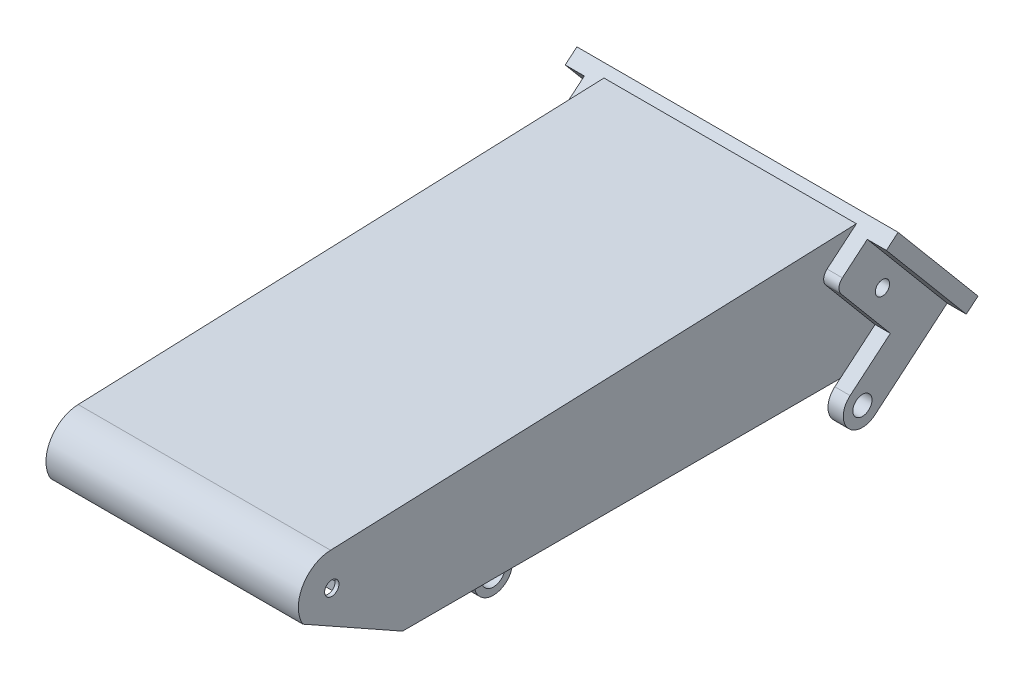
ISO-10303-21;
HEADER;
FILE_DESCRIPTION(('STEP AP214'),'2;1');
FILE_NAME('part.step','',(''),(''),'','','');
FILE_SCHEMA(('AUTOMOTIVE_DESIGN { 1 0 10303 214 1 1 1 1 }'));
ENDSEC;
DATA;
#1=APPLICATION_CONTEXT('core data for automotive mechanical design processes');
#2=APPLICATION_PROTOCOL_DEFINITION('international standard','automotive_design',2000,#1);
#3=PRODUCT_CONTEXT('',#1,'mechanical');
#4=PRODUCT('Part','Part','',(#3));
#5=PRODUCT_RELATED_PRODUCT_CATEGORY('part','',(#4));
#6=PRODUCT_DEFINITION_FORMATION('','',#4);
#7=PRODUCT_DEFINITION_CONTEXT('part definition',#1,'design');
#8=PRODUCT_DEFINITION('design','',#6,#7);
#9=PRODUCT_DEFINITION_SHAPE('','',#8);
#10=(LENGTH_UNIT() NAMED_UNIT(*) SI_UNIT(.MILLI.,.METRE.));
#11=(NAMED_UNIT(*) PLANE_ANGLE_UNIT() SI_UNIT($,.RADIAN.));
#12=(NAMED_UNIT(*) SI_UNIT($,.STERADIAN.) SOLID_ANGLE_UNIT());
#13=UNCERTAINTY_MEASURE_WITH_UNIT(LENGTH_MEASURE(1.E-05),#10,'distance_accuracy_value','');
#14=(GEOMETRIC_REPRESENTATION_CONTEXT(3) GLOBAL_UNCERTAINTY_ASSIGNED_CONTEXT((#13)) GLOBAL_UNIT_ASSIGNED_CONTEXT((#10,
#11,#12)) REPRESENTATION_CONTEXT('',''));
#15=CARTESIAN_POINT('',(0.,0.,0.));
#16=DIRECTION('',(0.,0.,1.));
#17=DIRECTION('',(1.,0.,0.));
#18=AXIS2_PLACEMENT_3D('',#15,#16,#17);
#19=CARTESIAN_POINT('',(660.,0.,0.));
#20=DIRECTION('',(1.,0.,0.));
#21=DIRECTION('',(0.,0.,-1.));
#22=AXIS2_PLACEMENT_3D('',#19,#20,#21);
#23=PLANE('',#22);
#24=CARTESIAN_POINT('',(660.,0.,0.));
#25=DIRECTION('',(1.,0.,0.));
#26=DIRECTION('',(0.,0.,-1.));
#27=AXIS2_PLACEMENT_3D('',#24,#25,#26);
#28=CIRCLE('',#27,37.5);
#29=CARTESIAN_POINT('',(660.,0.,-37.5));
#30=VERTEX_POINT('',#29);
#31=EDGE_CURVE('E865',#30,#30,#28,.T.);
#32=ORIENTED_EDGE('',*,*,#31,.F.);
#33=EDGE_LOOP('',(#32));
#34=FACE_BOUND('',#33,.T.);
#35=DIRECTION('',(0.,0.,-1.));
#36=VECTOR('',#35,1.);
#37=CARTESIAN_POINT('',(660.,-380.040168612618,-2970.00486171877));
#38=LINE('',#37,#36);
#39=CARTESIAN_POINT('',(660.,-380.040168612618,-370.004861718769));
#40=VERTEX_POINT('',#39);
#41=CARTESIAN_POINT('',(660.,-380.040168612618,-2658.8600963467));
#42=VERTEX_POINT('',#41);
#43=EDGE_CURVE('E861',#40,#42,#38,.T.);
#44=ORIENTED_EDGE('',*,*,#43,.T.);
#45=DIRECTION('',(0.,-0.642787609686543,0.766044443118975));
#46=VECTOR('',#45,1.);
#47=CARTESIAN_POINT('',(660.,-1532.24974419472,-1285.71019522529));
#48=LINE('',#47,#46);
#49=CARTESIAN_POINT('',(660.,-226.831279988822,-2841.44733978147));
#50=VERTEX_POINT('',#49);
#51=EDGE_CURVE('E1051',#50,#42,#48,.T.);
#52=ORIENTED_EDGE('',*,*,#51,.F.);
#53=DIRECTION('',(0.,-0.766044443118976,-0.642787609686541));
#54=VECTOR('',#53,1.);
#55=CARTESIAN_POINT('',(660.,385.89481724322,-2327.30909758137));
#56=LINE('',#55,#54);
#57=CARTESIAN_POINT('',(660.,79.5864972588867,-2584.33229590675));
#58=VERTEX_POINT('',#57);
#59=EDGE_CURVE('E516',#58,#50,#56,.T.);
#60=ORIENTED_EDGE('',*,*,#59,.F.);
#61=CARTESIAN_POINT('',(660.,111.725877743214,-2622.6345180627));
#62=DIRECTION('',(1.,0.,0.));
#63=DIRECTION('',(0.,0.,-1.));
#64=AXIS2_PLACEMENT_3D('',#61,#62,#63);
#65=CIRCLE('',#64,50.);
#66=CARTESIAN_POINT('',(660.,150.028099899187,-2590.4951375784));
#67=VERTEX_POINT('',#66);
#68=EDGE_CURVE('E970',#58,#67,#65,.F.);
#69=ORIENTED_EDGE('',*,*,#68,.T.);
#70=DIRECTION('',(0.,-0.642787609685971,0.766044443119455));
#71=VECTOR('',#70,1.);
#72=CARTESIAN_POINT('',(660.,117.888719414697,-2552.1929154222));
#73=LINE('',#72,#71);
#74=CARTESIAN_POINT('',(660.,278.585621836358,-2743.70402620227));
#75=VERTEX_POINT('',#74);
#76=EDGE_CURVE('E509',#75,#67,#73,.T.);
#77=ORIENTED_EDGE('',*,*,#76,.F.);
#78=DIRECTION('',(0.,-0.0376818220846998,0.999289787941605));
#79=VECTOR('',#78,1.);
#80=CARTESIAN_POINT('',(660.,278.585621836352,-2743.70402620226));
#81=LINE('',#80,#79);
#82=CARTESIAN_POINT('',(660.,174.875712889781,6.59431886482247));
#83=VERTEX_POINT('',#82);
#84=EDGE_CURVE('E894',#75,#83,#81,.T.);
#85=ORIENTED_EDGE('',*,*,#84,.T.);
#86=CARTESIAN_POINT('',(660.,0.,0.));
#87=DIRECTION('',(1.,0.,0.));
#88=DIRECTION('',(0.,0.,-1.));
#89=AXIS2_PLACEMENT_3D('',#86,#87,#88);
#90=CIRCLE('',#89,175.);
#91=CARTESIAN_POINT('',(660.,-87.4999999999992,151.554445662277));
#92=VERTEX_POINT('',#91);
#93=EDGE_CURVE('E891',#83,#92,#90,.T.);
#94=ORIENTED_EDGE('',*,*,#93,.T.);
#95=DIRECTION('',(0.,0.489197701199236,0.872172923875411));
#96=VECTOR('',#95,1.);
#97=CARTESIAN_POINT('',(660.,-131.222966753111,73.6023464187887));
#98=LINE('',#97,#96);
#99=EDGE_CURVE('E877',#40,#92,#98,.T.);
#100=ORIENTED_EDGE('',*,*,#99,.F.);
#101=EDGE_LOOP('',(#44,#52,#60,#69,#77,#85,#94,#100));
#102=FACE_BOUND('',#101,.T.);
#103=ADVANCED_FACE('F59',(#34,#102),#23,.T.);
#104=CARTESIAN_POINT('',(660.,385.89481724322,-2327.30909758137));
#105=DIRECTION('',(0.,-0.642787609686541,0.766044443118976));
#106=DIRECTION('',(0.,-0.766044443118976,-0.642787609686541));
#107=AXIS2_PLACEMENT_3D('',#104,#105,#106);
#108=PLANE('',#107);
#109=ORIENTED_EDGE('',*,*,#59,.T.);
#110=DIRECTION('',(-1.,0.,0.));
#111=VECTOR('',#110,1.);
#112=CARTESIAN_POINT('',(740.,-226.831279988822,-2841.44733978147));
#113=LINE('',#112,#111);
#114=CARTESIAN_POINT('',(740.,-226.831279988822,-2841.44733978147));
#115=VERTEX_POINT('',#114);
#116=EDGE_CURVE('E377',#115,#50,#113,.T.);
#117=ORIENTED_EDGE('',*,*,#116,.F.);
#118=DIRECTION('',(0.,-0.766044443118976,-0.642787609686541));
#119=VECTOR('',#118,1.);
#120=CARTESIAN_POINT('',(740.,385.89481724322,-2327.30909758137));
#121=LINE('',#120,#119);
#122=CARTESIAN_POINT('',(740.,79.5864972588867,-2584.33229590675));
#123=VERTEX_POINT('',#122);
#124=EDGE_CURVE('E385',#123,#115,#121,.T.);
#125=ORIENTED_EDGE('',*,*,#124,.F.);
#126=DIRECTION('',(1.,0.,0.));
#127=VECTOR('',#126,1.);
#128=CARTESIAN_POINT('',(660.,79.5864972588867,-2584.33229590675));
#129=LINE('',#128,#127);
#130=EDGE_CURVE('E979',#123,#58,#129,.F.);
#131=ORIENTED_EDGE('',*,*,#130,.T.);
#132=EDGE_LOOP('',(#109,#117,#125,#131));
#133=FACE_BOUND('',#132,.T.);
#134=ADVANCED_FACE('F777',(#133),#108,.T.);
#135=CARTESIAN_POINT('',(-660.,0.,0.));
#136=DIRECTION('',(1.,0.,0.));
#137=DIRECTION('',(0.,0.,-1.));
#138=AXIS2_PLACEMENT_3D('',#135,#136,#137);
#139=PLANE('',#138);
#140=CARTESIAN_POINT('',(-660.,0.,0.));
#141=DIRECTION('',(1.,0.,0.));
#142=DIRECTION('',(0.,0.,-1.));
#143=AXIS2_PLACEMENT_3D('',#140,#141,#142);
#144=CIRCLE('',#143,37.5);
#145=CARTESIAN_POINT('',(-660.,0.,-37.5));
#146=VERTEX_POINT('',#145);
#147=EDGE_CURVE('E1023',#146,#146,#144,.T.);
#148=ORIENTED_EDGE('',*,*,#147,.T.);
#149=EDGE_LOOP('',(#148));
#150=FACE_BOUND('',#149,.T.);
#151=DIRECTION('',(0.,0.642787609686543,-0.766044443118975));
#152=VECTOR('',#151,1.);
#153=CARTESIAN_POINT('',(-660.,-226.831279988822,-2841.44733978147));
#154=LINE('',#153,#152);
#155=CARTESIAN_POINT('',(-660.,-380.040168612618,-2658.8600963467));
#156=VERTEX_POINT('',#155);
#157=CARTESIAN_POINT('',(-660.,-226.831279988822,-2841.44733978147));
#158=VERTEX_POINT('',#157);
#159=EDGE_CURVE('E75',#156,#158,#154,.T.);
#160=ORIENTED_EDGE('',*,*,#159,.F.);
#161=DIRECTION('',(0.,0.,-1.));
#162=VECTOR('',#161,1.);
#163=CARTESIAN_POINT('',(-660.,-380.040168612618,-2970.00486171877));
#164=LINE('',#163,#162);
#165=CARTESIAN_POINT('',(-660.,-380.040168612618,-1095.00486171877));
#166=VERTEX_POINT('',#165);
#167=EDGE_CURVE('E866',#166,#156,#164,.T.);
#168=ORIENTED_EDGE('',*,*,#167,.F.);
#169=DIRECTION('',(0.,0.975609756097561,-0.219512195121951));
#170=VECTOR('',#169,1.);
#171=CARTESIAN_POINT('',(-660.,-252.816778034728,-1123.63012459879));
#172=LINE('',#171,#170);
#173=CARTESIAN_POINT('',(-660.,-280.040168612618,-1117.50486171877));
#174=VERTEX_POINT('',#173);
#175=EDGE_CURVE('E1130',#166,#174,#172,.T.);
#176=ORIENTED_EDGE('',*,*,#175,.T.);
#177=DIRECTION('',(0.,0.,1.));
#178=VECTOR('',#177,1.);
#179=CARTESIAN_POINT('',(-660.,-280.040168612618,0.));
#180=LINE('',#179,#178);
#181=CARTESIAN_POINT('',(-660.,-280.040168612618,-822.504861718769));
#182=VERTEX_POINT('',#181);
#183=EDGE_CURVE('E1127',#174,#182,#180,.T.);
#184=ORIENTED_EDGE('',*,*,#183,.T.);
#185=DIRECTION('',(0.,-0.975609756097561,-0.219512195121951));
#186=VECTOR('',#185,1.);
#187=CARTESIAN_POINT('',(-660.,162.652288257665,-722.899058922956));
#188=LINE('',#187,#186);
#189=CARTESIAN_POINT('',(-660.,-380.040168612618,-845.00486171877));
#190=VERTEX_POINT('',#189);
#191=EDGE_CURVE('E1123',#182,#190,#188,.T.);
#192=ORIENTED_EDGE('',*,*,#191,.T.);
#193=CARTESIAN_POINT('',(-660.,-380.040168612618,-370.004861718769));
#194=VERTEX_POINT('',#193);
#195=EDGE_CURVE('E862',#194,#190,#164,.T.);
#196=ORIENTED_EDGE('',*,*,#195,.F.);
#197=DIRECTION('',(0.,-0.489197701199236,-0.872172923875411));
#198=VECTOR('',#197,1.);
#199=CARTESIAN_POINT('',(-660.,-131.222966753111,73.6023464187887));
#200=LINE('',#199,#198);
#201=CARTESIAN_POINT('',(-660.,-87.4999999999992,151.554445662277));
#202=VERTEX_POINT('',#201);
#203=EDGE_CURVE('E836',#202,#194,#200,.T.);
#204=ORIENTED_EDGE('',*,*,#203,.F.);
#205=CARTESIAN_POINT('',(-660.,0.,0.));
#206=DIRECTION('',(1.,0.,0.));
#207=DIRECTION('',(0.,0.,-1.));
#208=AXIS2_PLACEMENT_3D('',#205,#206,#207);
#209=CIRCLE('',#208,175.);
#210=CARTESIAN_POINT('',(-660.,174.875712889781,6.59431886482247));
#211=VERTEX_POINT('',#210);
#212=EDGE_CURVE('E895',#211,#202,#209,.T.);
#213=ORIENTED_EDGE('',*,*,#212,.F.);
#214=DIRECTION('',(0.,-0.0376818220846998,0.999289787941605));
#215=VECTOR('',#214,1.);
#216=CARTESIAN_POINT('',(-660.,278.585621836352,-2743.70402620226));
#217=LINE('',#216,#215);
#218=CARTESIAN_POINT('',(-660.,278.585621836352,-2743.70402620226));
#219=VERTEX_POINT('',#218);
#220=EDGE_CURVE('E890',#219,#211,#217,.T.);
#221=ORIENTED_EDGE('',*,*,#220,.F.);
#222=DIRECTION('',(0.,0.642787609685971,-0.766044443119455));
#223=VECTOR('',#222,1.);
#224=CARTESIAN_POINT('',(-660.,117.888719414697,-2552.1929154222));
#225=LINE('',#224,#223);
#226=CARTESIAN_POINT('',(-660.,150.028099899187,-2590.4951375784));
#227=VERTEX_POINT('',#226);
#228=EDGE_CURVE('E989',#227,#219,#225,.T.);
#229=ORIENTED_EDGE('',*,*,#228,.F.);
#230=CARTESIAN_POINT('',(-660.,111.725877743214,-2622.6345180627));
#231=DIRECTION('',(1.,0.,0.));
#232=DIRECTION('',(0.,0.,-1.));
#233=AXIS2_PLACEMENT_3D('',#230,#231,#232);
#234=CIRCLE('',#233,50.);
#235=CARTESIAN_POINT('',(-660.,79.5864972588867,-2584.33229590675));
#236=VERTEX_POINT('',#235);
#237=EDGE_CURVE('E969',#227,#236,#234,.T.);
#238=ORIENTED_EDGE('',*,*,#237,.T.);
#239=DIRECTION('',(0.,-0.766044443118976,-0.642787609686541));
#240=VECTOR('',#239,1.);
#241=CARTESIAN_POINT('',(-660.,385.89481724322,-2327.30909758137));
#242=LINE('',#241,#240);
#243=EDGE_CURVE('E548',#236,#158,#242,.T.);
#244=ORIENTED_EDGE('',*,*,#243,.T.);
#245=EDGE_LOOP('',(#160,#168,#176,#184,#192,#196,#204,#213,#221,#229,#238,#244));
#246=FACE_BOUND('',#245,.T.);
#247=ADVANCED_FACE('F671',(#150,#246),#139,.F.);
#248=CARTESIAN_POINT('',(-660.,385.89481724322,-2327.30909758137));
#249=DIRECTION('',(0.,-0.642787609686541,0.766044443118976));
#250=DIRECTION('',(0.,-0.766044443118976,-0.642787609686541));
#251=AXIS2_PLACEMENT_3D('',#248,#249,#250);
#252=PLANE('',#251);
#253=DIRECTION('',(0.,-0.766044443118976,-0.642787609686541));
#254=VECTOR('',#253,1.);
#255=CARTESIAN_POINT('',(-740.,385.89481724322,-2327.30909758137));
#256=LINE('',#255,#254);
#257=CARTESIAN_POINT('',(-740.,79.5864972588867,-2584.33229590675));
#258=VERTEX_POINT('',#257);
#259=CARTESIAN_POINT('',(-740.,-226.831279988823,-2841.44733978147));
#260=VERTEX_POINT('',#259);
#261=EDGE_CURVE('E546',#258,#260,#256,.T.);
#262=ORIENTED_EDGE('',*,*,#261,.T.);
#263=DIRECTION('',(1.,0.,0.));
#264=VECTOR('',#263,1.);
#265=CARTESIAN_POINT('',(-740.,-226.831279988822,-2841.44733978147));
#266=LINE('',#265,#264);
#267=EDGE_CURVE('E83',#260,#158,#266,.T.);
#268=ORIENTED_EDGE('',*,*,#267,.T.);
#269=ORIENTED_EDGE('',*,*,#243,.F.);
#270=DIRECTION('',(1.,0.,0.));
#271=VECTOR('',#270,1.);
#272=CARTESIAN_POINT('',(-740.,79.5864972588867,-2584.33229590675));
#273=LINE('',#272,#271);
#274=EDGE_CURVE('E977',#236,#258,#273,.F.);
#275=ORIENTED_EDGE('',*,*,#274,.T.);
#276=EDGE_LOOP('',(#262,#268,#269,#275));
#277=FACE_BOUND('',#276,.T.);
#278=ADVANCED_FACE('F802',(#277),#252,.T.);
#279=CARTESIAN_POINT('',(660.,-380.040168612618,-2970.00486171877));
#280=DIRECTION('',(0.,1.,0.));
#281=DIRECTION('',(0.,0.,1.));
#282=AXIS2_PLACEMENT_3D('',#279,#280,#281);
#283=PLANE('',#282);
#284=ORIENTED_EDGE('',*,*,#195,.T.);
#285=DIRECTION('',(1.,0.,0.));
#286=VECTOR('',#285,1.);
#287=CARTESIAN_POINT('',(-695.,-380.040168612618,-845.004861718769));
#288=LINE('',#287,#286);
#289=CARTESIAN_POINT('',(-620.,-380.040168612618,-845.00486171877));
#290=VERTEX_POINT('',#289);
#291=EDGE_CURVE('E460',#190,#290,#288,.T.);
#292=ORIENTED_EDGE('',*,*,#291,.T.);
#293=DIRECTION('',(0.,0.,1.));
#294=VECTOR('',#293,1.);
#295=CARTESIAN_POINT('',(-620.,-380.040168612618,-845.004861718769));
#296=LINE('',#295,#294);
#297=CARTESIAN_POINT('',(-620.,-380.040168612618,-1095.00486171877));
#298=VERTEX_POINT('',#297);
#299=EDGE_CURVE('E452',#298,#290,#296,.T.);
#300=ORIENTED_EDGE('',*,*,#299,.F.);
#301=DIRECTION('',(1.,0.,0.));
#302=VECTOR('',#301,1.);
#303=CARTESIAN_POINT('',(-695.,-380.040168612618,-1095.00486171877));
#304=LINE('',#303,#302);
#305=EDGE_CURVE('E462',#166,#298,#304,.T.);
#306=ORIENTED_EDGE('',*,*,#305,.F.);
#307=ORIENTED_EDGE('',*,*,#167,.T.);
#308=DIRECTION('',(0.,0.,1.));
#309=VECTOR('',#308,1.);
#310=CARTESIAN_POINT('',(-660.,-380.040168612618,-2970.00486171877));
#311=LINE('',#310,#309);
#312=CARTESIAN_POINT('',(-660.,-380.040168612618,-2970.00486171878));
#313=VERTEX_POINT('',#312);
#314=EDGE_CURVE('E427',#313,#156,#311,.T.);
#315=ORIENTED_EDGE('',*,*,#314,.F.);
#316=DIRECTION('',(-1.,0.,0.));
#317=VECTOR('',#316,1.);
#318=CARTESIAN_POINT('',(660.,-380.040168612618,-2970.00486171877));
#319=LINE('',#318,#317);
#320=CARTESIAN_POINT('',(660.,-380.040168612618,-2970.00486171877));
#321=VERTEX_POINT('',#320);
#322=EDGE_CURVE('E858',#321,#313,#319,.T.);
#323=ORIENTED_EDGE('',*,*,#322,.F.);
#324=DIRECTION('',(0.,0.,-1.));
#325=VECTOR('',#324,1.);
#326=CARTESIAN_POINT('',(660.,-380.040168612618,-2970.00486171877));
#327=LINE('',#326,#325);
#328=EDGE_CURVE('E394',#42,#321,#327,.T.);
#329=ORIENTED_EDGE('',*,*,#328,.F.);
#330=ORIENTED_EDGE('',*,*,#43,.F.);
#331=DIRECTION('',(1.,0.,0.));
#332=VECTOR('',#331,1.);
#333=CARTESIAN_POINT('',(640.,-380.040168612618,-370.004861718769));
#334=LINE('',#333,#332);
#335=CARTESIAN_POINT('',(640.,-380.040168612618,-370.004861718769));
#336=VERTEX_POINT('',#335);
#337=EDGE_CURVE('E644',#336,#40,#334,.T.);
#338=ORIENTED_EDGE('',*,*,#337,.F.);
#339=DIRECTION('',(-1.,0.,0.));
#340=VECTOR('',#339,1.);
#341=CARTESIAN_POINT('',(660.,-380.040168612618,-370.004861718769));
#342=LINE('',#341,#340);
#343=CARTESIAN_POINT('',(-640.,-380.040168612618,-370.004861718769));
#344=VERTEX_POINT('',#343);
#345=EDGE_CURVE('E820',#336,#344,#342,.T.);
#346=ORIENTED_EDGE('',*,*,#345,.T.);
#347=DIRECTION('',(-1.,0.,0.));
#348=VECTOR('',#347,1.);
#349=CARTESIAN_POINT('',(-640.,-380.040168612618,-370.004861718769));
#350=LINE('',#349,#348);
#351=EDGE_CURVE('E852',#344,#194,#350,.T.);
#352=ORIENTED_EDGE('',*,*,#351,.T.);
#353=EDGE_LOOP('',(#284,#292,#300,#306,#307,#315,#323,#329,#330,#338,#346,#352));
#354=FACE_BOUND('',#353,.T.);
#355=DIRECTION('',(-1.,0.,0.));
#356=VECTOR('',#355,1.);
#357=CARTESIAN_POINT('',(535.,-380.040168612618,-1095.00486171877));
#358=LINE('',#357,#356);
#359=CARTESIAN_POINT('',(535.,-380.040168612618,-1095.00486171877));
#360=VERTEX_POINT('',#359);
#361=CARTESIAN_POINT('',(460.,-380.040168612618,-1095.00486171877));
#362=VERTEX_POINT('',#361);
#363=EDGE_CURVE('E498',#360,#362,#358,.T.);
#364=ORIENTED_EDGE('',*,*,#363,.T.);
#365=DIRECTION('',(0.,0.,1.));
#366=VECTOR('',#365,1.);
#367=CARTESIAN_POINT('',(460.,-380.040168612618,-845.004861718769));
#368=LINE('',#367,#366);
#369=CARTESIAN_POINT('',(460.,-380.040168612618,-845.004861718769));
#370=VERTEX_POINT('',#369);
#371=EDGE_CURVE('E490',#362,#370,#368,.T.);
#372=ORIENTED_EDGE('',*,*,#371,.T.);
#373=DIRECTION('',(-1.,0.,0.));
#374=VECTOR('',#373,1.);
#375=CARTESIAN_POINT('',(535.,-380.040168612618,-845.004861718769));
#376=LINE('',#375,#374);
#377=CARTESIAN_POINT('',(535.,-380.040168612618,-845.00486171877));
#378=VERTEX_POINT('',#377);
#379=EDGE_CURVE('E495',#378,#370,#376,.T.);
#380=ORIENTED_EDGE('',*,*,#379,.F.);
#381=DIRECTION('',(0.,0.,1.));
#382=VECTOR('',#381,1.);
#383=CARTESIAN_POINT('',(535.,-380.040168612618,-845.004861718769));
#384=LINE('',#383,#382);
#385=EDGE_CURVE('E479',#360,#378,#384,.T.);
#386=ORIENTED_EDGE('',*,*,#385,.F.);
#387=EDGE_LOOP('',(#364,#372,#380,#386));
#388=FACE_BOUND('',#387,.T.);
#389=ADVANCED_FACE('F679',(#354,#388),#283,.F.);
#390=CARTESIAN_POINT('',(660.,-72.4999999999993,125.573683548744));
#391=DIRECTION('',(0.,0.866025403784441,0.499999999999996));
#392=DIRECTION('',(0.,-0.499999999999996,0.866025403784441));
#393=AXIS2_PLACEMENT_3D('',#390,#391,#392);
#394=PLANE('',#393);
#395=DIRECTION('',(-1.,0.,0.));
#396=VECTOR('',#395,1.);
#397=CARTESIAN_POINT('',(660.,-87.4999999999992,151.554445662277));
#398=LINE('',#397,#396);
#399=CARTESIAN_POINT('',(640.,-87.4999999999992,151.554445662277));
#400=VERTEX_POINT('',#399);
#401=CARTESIAN_POINT('',(-640.,-87.4999999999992,151.554445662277));
#402=VERTEX_POINT('',#401);
#403=EDGE_CURVE('E903',#400,#402,#398,.T.);
#404=ORIENTED_EDGE('',*,*,#403,.T.);
#405=DIRECTION('',(0.,-0.499999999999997,0.86602540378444));
#406=VECTOR('',#405,1.);
#407=CARTESIAN_POINT('',(-640.,2.88444402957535E-13,1.66533453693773E-13));
#408=LINE('',#407,#406);
#409=CARTESIAN_POINT('',(-640.,-72.4999999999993,125.573683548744));
#410=VERTEX_POINT('',#409);
#411=EDGE_CURVE('E843',#410,#402,#408,.T.);
#412=ORIENTED_EDGE('',*,*,#411,.F.);
#413=DIRECTION('',(-1.,0.,0.));
#414=VECTOR('',#413,1.);
#415=CARTESIAN_POINT('',(660.,-72.4999999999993,125.573683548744));
#416=LINE('',#415,#414);
#417=CARTESIAN_POINT('',(640.,-72.4999999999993,125.573683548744));
#418=VERTEX_POINT('',#417);
#419=EDGE_CURVE('E900',#418,#410,#416,.T.);
#420=ORIENTED_EDGE('',*,*,#419,.F.);
#421=DIRECTION('',(0.,0.499999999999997,-0.86602540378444));
#422=VECTOR('',#421,1.);
#423=CARTESIAN_POINT('',(640.,2.88444402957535E-13,1.66533453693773E-13));
#424=LINE('',#423,#422);
#425=EDGE_CURVE('E881',#400,#418,#424,.T.);
#426=ORIENTED_EDGE('',*,*,#425,.F.);
#427=EDGE_LOOP('',(#404,#412,#420,#426));
#428=FACE_BOUND('',#427,.T.);
#429=ADVANCED_FACE('F675',(#428),#394,.F.);
#430=CARTESIAN_POINT('',(660.,0.,0.));
#431=DIRECTION('',(-1.,0.,0.));
#432=DIRECTION('',(0.,0.,1.));
#433=AXIS2_PLACEMENT_3D('',#430,#431,#432);
#434=CYLINDRICAL_SURFACE('',#433,145.);
#435=ORIENTED_EDGE('',*,*,#419,.T.);
#436=CARTESIAN_POINT('',(-640.,0.,0.));
#437=DIRECTION('',(1.,0.,0.));
#438=DIRECTION('',(0.,0.,-1.));
#439=AXIS2_PLACEMENT_3D('',#436,#437,#438);
#440=CIRCLE('',#439,145.);
#441=CARTESIAN_POINT('',(-640.,144.897019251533,5.46386420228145));
#442=VERTEX_POINT('',#441);
#443=EDGE_CURVE('E840',#442,#410,#440,.T.);
#444=ORIENTED_EDGE('',*,*,#443,.F.);
#445=DIRECTION('',(-1.,0.,0.));
#446=VECTOR('',#445,1.);
#447=CARTESIAN_POINT('',(660.,144.897019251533,5.46386420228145));
#448=LINE('',#447,#446);
#449=CARTESIAN_POINT('',(640.,144.897019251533,5.46386420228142));
#450=VERTEX_POINT('',#449);
#451=EDGE_CURVE('E897',#450,#442,#448,.T.);
#452=ORIENTED_EDGE('',*,*,#451,.F.);
#453=CARTESIAN_POINT('',(640.,0.,0.));
#454=DIRECTION('',(1.,0.,0.));
#455=DIRECTION('',(0.,0.,-1.));
#456=AXIS2_PLACEMENT_3D('',#453,#454,#455);
#457=CIRCLE('',#456,145.);
#458=EDGE_CURVE('E878',#450,#418,#457,.T.);
#459=ORIENTED_EDGE('',*,*,#458,.T.);
#460=EDGE_LOOP('',(#435,#444,#452,#459));
#461=FACE_BOUND('',#460,.T.);
#462=ADVANCED_FACE('F670',(#461),#434,.F.);
#463=CARTESIAN_POINT('',(660.,144.897019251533,5.46386420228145));
#464=DIRECTION('',(0.,0.999289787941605,0.0376818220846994));
#465=DIRECTION('',(0.,-0.0376818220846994,0.999289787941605));
#466=AXIS2_PLACEMENT_3D('',#463,#464,#465);
#467=PLANE('',#466);
#468=ORIENTED_EDGE('',*,*,#451,.T.);
#469=DIRECTION('',(0.,-0.0376818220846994,0.999289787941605));
#470=VECTOR('',#469,1.);
#471=CARTESIAN_POINT('',(-640.,144.897019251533,5.46386420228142));
#472=LINE('',#471,#470);
#473=CARTESIAN_POINT('',(-640.,245.801805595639,-2670.44502155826));
#474=VERTEX_POINT('',#473);
#475=EDGE_CURVE('E844',#474,#442,#472,.T.);
#476=ORIENTED_EDGE('',*,*,#475,.F.);
#477=CARTESIAN_POINT('',(-790.,245.801805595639,-2670.44502155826));
#478=DIRECTION('',(0.,0.999289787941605,0.0376818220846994));
#479=DIRECTION('',(0.,0.0376818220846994,-0.999289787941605));
#480=AXIS2_PLACEMENT_3D('',#477,#478,#479);
#481=ELLIPSE('',#480,189.940306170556,150.);
#482=CARTESIAN_POINT('',(-661.387055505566,249.485078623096,-2768.12228127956));
#483=VERTEX_POINT('',#482);
#484=EDGE_CURVE('E945',#474,#483,#481,.T.);
#485=ORIENTED_EDGE('',*,*,#484,.T.);
#486=DIRECTION('',(-1.,0.,0.));
#487=VECTOR('',#486,1.);
#488=CARTESIAN_POINT('',(659.999999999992,249.485078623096,-2768.12228127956));
#489=LINE('',#488,#487);
#490=CARTESIAN_POINT('',(-640.,249.485078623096,-2768.12228127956));
#491=VERTEX_POINT('',#490);
#492=EDGE_CURVE('E966',#491,#483,#489,.T.);
#493=ORIENTED_EDGE('',*,*,#492,.F.);
#494=CARTESIAN_POINT('',(640.,249.485078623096,-2768.12228127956));
#495=DIRECTION('',(-1.,0.,0.));
#496=VECTOR('',#495,1.);
#497=LINE('',#494,#496);
#498=CARTESIAN_POINT('',(640.,249.485078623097,-2768.12228127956));
#499=VERTEX_POINT('',#498);
#500=EDGE_CURVE('E652',#499,#491,#497,.T.);
#501=ORIENTED_EDGE('',*,*,#500,.F.);
#502=DIRECTION('',(1.,0.,0.));
#503=VECTOR('',#502,1.);
#504=CARTESIAN_POINT('',(-7.96517802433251E-12,249.485078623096,-2768.12228127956));
#505=LINE('',#504,#503);
#506=CARTESIAN_POINT('',(661.387055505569,249.485078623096,-2768.12228127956));
#507=VERTEX_POINT('',#506);
#508=EDGE_CURVE('E1108',#499,#507,#505,.T.);
#509=ORIENTED_EDGE('',*,*,#508,.T.);
#510=CARTESIAN_POINT('',(790.,245.801805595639,-2670.44502155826));
#511=DIRECTION('',(0.,0.999289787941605,0.0376818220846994));
#512=DIRECTION('',(0.,0.0376818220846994,-0.999289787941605));
#513=AXIS2_PLACEMENT_3D('',#510,#511,#512);
#514=ELLIPSE('',#513,189.940306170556,150.);
#515=CARTESIAN_POINT('',(640.,245.801805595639,-2670.44502155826));
#516=VERTEX_POINT('',#515);
#517=EDGE_CURVE('E935',#507,#516,#514,.T.);
#518=ORIENTED_EDGE('',*,*,#517,.T.);
#519=DIRECTION('',(0.,0.0376818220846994,-0.999289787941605));
#520=VECTOR('',#519,1.);
#521=CARTESIAN_POINT('',(640.,144.897019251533,5.46386420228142));
#522=LINE('',#521,#520);
#523=EDGE_CURVE('E638',#450,#516,#522,.T.);
#524=ORIENTED_EDGE('',*,*,#523,.F.);
#525=EDGE_LOOP('',(#468,#476,#485,#493,#501,#509,#518,#524));
#526=FACE_BOUND('',#525,.T.);
#527=ADVANCED_FACE('F659',(#526),#467,.F.);
#528=CARTESIAN_POINT('',(660.,278.585621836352,-2743.70402620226));
#529=DIRECTION('',(0.,-0.999289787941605,-0.0376818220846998));
#530=DIRECTION('',(0.,0.0376818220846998,-0.999289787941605));
#531=AXIS2_PLACEMENT_3D('',#528,#529,#530);
#532=PLANE('',#531);
#533=ORIENTED_EDGE('',*,*,#220,.T.);
#534=DIRECTION('',(-1.,0.,0.));
#535=VECTOR('',#534,1.);
#536=CARTESIAN_POINT('',(660.,174.875712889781,6.59431886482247));
#537=LINE('',#536,#535);
#538=EDGE_CURVE('E907',#83,#211,#537,.T.);
#539=ORIENTED_EDGE('',*,*,#538,.F.);
#540=ORIENTED_EDGE('',*,*,#84,.F.);
#541=CARTESIAN_POINT('',(660.,278.585621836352,-2743.70402620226));
#542=DIRECTION('',(-1.,0.,0.));
#543=VECTOR('',#542,1.);
#544=LINE('',#541,#543);
#545=EDGE_CURVE('E910',#75,#219,#544,.T.);
#546=ORIENTED_EDGE('',*,*,#545,.T.);
#547=EDGE_LOOP('',(#533,#539,#540,#546));
#548=FACE_BOUND('',#547,.T.);
#549=ADVANCED_FACE('F669',(#548),#532,.F.);
#550=CARTESIAN_POINT('',(660.,0.,0.));
#551=DIRECTION('',(-1.,0.,0.));
#552=DIRECTION('',(0.,0.,1.));
#553=AXIS2_PLACEMENT_3D('',#550,#551,#552);
#554=CYLINDRICAL_SURFACE('',#553,175.);
#555=ORIENTED_EDGE('',*,*,#212,.T.);
#556=DIRECTION('',(-1.,0.,0.));
#557=VECTOR('',#556,1.);
#558=CARTESIAN_POINT('',(-640.,-87.4999999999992,151.554445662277));
#559=LINE('',#558,#557);
#560=EDGE_CURVE('E846',#402,#202,#559,.T.);
#561=ORIENTED_EDGE('',*,*,#560,.F.);
#562=ORIENTED_EDGE('',*,*,#403,.F.);
#563=EDGE_CURVE('E904',#92,#400,#398,.T.);
#564=ORIENTED_EDGE('',*,*,#563,.F.);
#565=ORIENTED_EDGE('',*,*,#93,.F.);
#566=ORIENTED_EDGE('',*,*,#538,.T.);
#567=EDGE_LOOP('',(#555,#561,#562,#564,#565,#566));
#568=FACE_BOUND('',#567,.T.);
#569=ADVANCED_FACE('F681',(#568),#554,.T.);
#570=CARTESIAN_POINT('',(640.,-131.222966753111,73.6023464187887));
#571=DIRECTION('',(0.,0.872172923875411,-0.489197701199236));
#572=DIRECTION('',(0.,0.489197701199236,0.872172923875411));
#573=AXIS2_PLACEMENT_3D('',#570,#571,#572);
#574=PLANE('',#573);
#575=ORIENTED_EDGE('',*,*,#99,.T.);
#576=ORIENTED_EDGE('',*,*,#563,.T.);
#577=DIRECTION('',(0.,0.489197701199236,0.872172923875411));
#578=VECTOR('',#577,1.);
#579=CARTESIAN_POINT('',(640.,-131.222966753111,73.6023464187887));
#580=LINE('',#579,#578);
#581=EDGE_CURVE('E883',#336,#400,#580,.T.);
#582=ORIENTED_EDGE('',*,*,#581,.F.);
#583=ORIENTED_EDGE('',*,*,#337,.T.);
#584=EDGE_LOOP('',(#575,#576,#582,#583));
#585=FACE_BOUND('',#584,.T.);
#586=ADVANCED_FACE('F684',(#585),#574,.F.);
#587=CARTESIAN_POINT('',(640.,0.,0.));
#588=DIRECTION('',(1.,0.,0.));
#589=DIRECTION('',(0.,0.,-1.));
#590=AXIS2_PLACEMENT_3D('',#587,#588,#589);
#591=PLANE('',#590);
#592=CARTESIAN_POINT('',(640.,0.,0.));
#593=DIRECTION('',(1.,0.,0.));
#594=DIRECTION('',(0.,0.,-1.));
#595=AXIS2_PLACEMENT_3D('',#592,#593,#594);
#596=CIRCLE('',#595,37.5);
#597=CARTESIAN_POINT('',(640.,0.,-37.5));
#598=VERTEX_POINT('',#597);
#599=EDGE_CURVE('E869',#598,#598,#596,.T.);
#600=ORIENTED_EDGE('',*,*,#599,.T.);
#601=EDGE_LOOP('',(#600));
#602=FACE_BOUND('',#601,.T.);
#603=CARTESIAN_POINT('',(640.,-1.56985535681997E-11,-2800.));
#604=DIRECTION('',(1.,0.,0.));
#605=DIRECTION('',(0.,0.,-1.));
#606=AXIS2_PLACEMENT_3D('',#603,#604,#605);
#607=CIRCLE('',#606,37.5000000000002);
#608=CARTESIAN_POINT('',(640.,-1.56985535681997E-11,-2837.5));
#609=VERTEX_POINT('',#608);
#610=EDGE_CURVE('E872',#609,#609,#607,.T.);
#611=ORIENTED_EDGE('',*,*,#610,.T.);
#612=EDGE_LOOP('',(#611));
#613=FACE_BOUND('',#612,.T.);
#614=ORIENTED_EDGE('',*,*,#523,.T.);
#615=DIRECTION('',(0.,-0.766044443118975,-0.642787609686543));
#616=VECTOR('',#615,1.);
#617=CARTESIAN_POINT('',(640.,1416.49686560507,-1688.11522848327));
#618=LINE('',#617,#616);
#619=CARTESIAN_POINT('',(640.,-227.06263298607,-3067.22539756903));
#620=VERTEX_POINT('',#619);
#621=EDGE_CURVE('E940',#516,#620,#618,.T.);
#622=ORIENTED_EDGE('',*,*,#621,.T.);
#623=CARTESIAN_POINT('',(640.,306.829186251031,-2720.00486171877));
#624=DIRECTION('',(1.,0.,0.));
#625=DIRECTION('',(0.,0.,-1.));
#626=AXIS2_PLACEMENT_3D('',#623,#624,#625);
#627=CIRCLE('',#626,636.869354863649);
#628=CARTESIAN_POINT('',(640.,-330.040168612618,-2720.00486171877));
#629=VERTEX_POINT('',#628);
#630=EDGE_CURVE('E630',#629,#620,#627,.T.);
#631=ORIENTED_EDGE('',*,*,#630,.F.);
#632=DIRECTION('',(0.,0.,1.));
#633=VECTOR('',#632,1.);
#634=CARTESIAN_POINT('',(640.,-330.040168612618,0.));
#635=LINE('',#634,#633);
#636=CARTESIAN_POINT('',(640.,-330.040168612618,-370.004861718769));
#637=VERTEX_POINT('',#636);
#638=EDGE_CURVE('E639',#629,#637,#635,.T.);
#639=ORIENTED_EDGE('',*,*,#638,.T.);
#640=DIRECTION('',(0.,-1.,0.));
#641=VECTOR('',#640,1.);
#642=CARTESIAN_POINT('',(640.,0.,-370.004861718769));
#643=LINE('',#642,#641);
#644=EDGE_CURVE('E818',#637,#336,#643,.T.);
#645=ORIENTED_EDGE('',*,*,#644,.T.);
#646=ORIENTED_EDGE('',*,*,#581,.T.);
#647=ORIENTED_EDGE('',*,*,#425,.T.);
#648=ORIENTED_EDGE('',*,*,#458,.F.);
#649=EDGE_LOOP('',(#614,#622,#631,#639,#645,#646,#647,#648));
#650=FACE_BOUND('',#649,.T.);
#651=ADVANCED_FACE('F789',(#602,#613,#650),#591,.F.);
#652=CARTESIAN_POINT('',(640.,-1.56985535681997E-11,-2800.));
#653=DIRECTION('',(1.,0.,0.));
#654=DIRECTION('',(0.,0.,-1.));
#655=AXIS2_PLACEMENT_3D('',#652,#653,#654);
#656=CYLINDRICAL_SURFACE('',#655,37.5000000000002);
#657=ORIENTED_EDGE('',*,*,#610,.F.);
#658=EDGE_LOOP('',(#657));
#659=FACE_BOUND('',#658,.T.);
#660=CARTESIAN_POINT('',(740.,-1.56985535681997E-11,-2800.));
#661=DIRECTION('',(1.,0.,0.));
#662=DIRECTION('',(0.,0.,-1.));
#663=AXIS2_PLACEMENT_3D('',#660,#661,#662);
#664=CIRCLE('',#663,37.5000000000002);
#665=CARTESIAN_POINT('',(740.,-1.56985535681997E-11,-2837.5));
#666=VERTEX_POINT('',#665);
#667=EDGE_CURVE('E503',#666,#666,#664,.T.);
#668=ORIENTED_EDGE('',*,*,#667,.T.);
#669=EDGE_LOOP('',(#668));
#670=FACE_BOUND('',#669,.T.);
#671=ADVANCED_FACE('F793',(#659,#670),#656,.F.);
#672=CARTESIAN_POINT('',(640.,0.,0.));
#673=DIRECTION('',(1.,0.,0.));
#674=DIRECTION('',(0.,0.,-1.));
#675=AXIS2_PLACEMENT_3D('',#672,#673,#674);
#676=CYLINDRICAL_SURFACE('',#675,37.5);
#677=ORIENTED_EDGE('',*,*,#599,.F.);
#678=EDGE_LOOP('',(#677));
#679=FACE_BOUND('',#678,.T.);
#680=ORIENTED_EDGE('',*,*,#31,.T.);
#681=EDGE_LOOP('',(#680));
#682=FACE_BOUND('',#681,.T.);
#683=ADVANCED_FACE('F732',(#679,#682),#676,.F.);
#684=CARTESIAN_POINT('',(660.,306.829186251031,-2720.00486171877));
#685=DIRECTION('',(-1.,0.,0.));
#686=DIRECTION('',(0.,0.,1.));
#687=AXIS2_PLACEMENT_3D('',#684,#685,#686);
#688=CYLINDRICAL_SURFACE('',#687,636.869354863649);
#689=CARTESIAN_POINT('',(640.,-181.041044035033,-3129.37659201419));
#690=DIRECTION('',(-1.,0.,0.));
#691=VECTOR('',#690,1.);
#692=LINE('',#689,#691);
#693=CARTESIAN_POINT('',(640.,-181.041044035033,-3129.37659201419));
#694=VERTEX_POINT('',#693);
#695=CARTESIAN_POINT('',(-640.,-181.041044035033,-3129.37659201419));
#696=VERTEX_POINT('',#695);
#697=EDGE_CURVE('E854',#694,#696,#692,.T.);
#698=ORIENTED_EDGE('',*,*,#697,.T.);
#699=DIRECTION('',(-1.,0.,0.));
#700=VECTOR('',#699,1.);
#701=CARTESIAN_POINT('',(-650.693527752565,-181.041044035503,-3129.37659201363));
#702=LINE('',#701,#700);
#703=CARTESIAN_POINT('',(-661.387055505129,-181.041044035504,-3129.37659201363));
#704=VERTEX_POINT('',#703);
#705=EDGE_CURVE('E960',#696,#704,#702,.T.);
#706=ORIENTED_EDGE('',*,*,#705,.T.);
#707=CARTESIAN_POINT('',(-661.387055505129,-181.041044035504,-3129.37659201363));
#708=CARTESIAN_POINT('',(-660.311401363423,-182.19300651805,-3128.00376096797));
#709=CARTESIAN_POINT('',(-659.273255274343,-183.353626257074,-3126.60879688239));
#710=CARTESIAN_POINT('',(-657.273718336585,-185.68924944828,-3123.7764922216));
#711=CARTESIAN_POINT('',(-656.31232877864,-186.864253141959,-3122.33915093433));
#712=CARTESIAN_POINT('',(-654.467854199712,-189.225964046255,-3119.4236703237));
#713=CARTESIAN_POINT('',(-653.584788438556,-190.412674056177,-3117.94552108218));
#714=CARTESIAN_POINT('',(-651.898804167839,-192.794558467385,-3114.95086902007));
#715=CARTESIAN_POINT('',(-651.095884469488,-193.98973274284,-3113.43436676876));
#716=CARTESIAN_POINT('',(-649.588958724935,-196.358353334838,-3110.40016729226));
#717=CARTESIAN_POINT('',(-648.883116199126,-197.531674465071,-3108.88328411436));
#718=CARTESIAN_POINT('',(-647.550470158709,-199.880946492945,-3105.81718203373));
#719=CARTESIAN_POINT('',(-646.923666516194,-201.056897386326,-3104.26796318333));
#720=CARTESIAN_POINT('',(-645.750284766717,-203.408429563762,-3101.13997900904));
#721=CARTESIAN_POINT('',(-645.203681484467,-204.584010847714,-3099.56122313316));
#722=CARTESIAN_POINT('',(-644.191341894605,-206.932494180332,-3096.37625554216));
#723=CARTESIAN_POINT('',(-643.725600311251,-208.10539639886,-3094.77004562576));
#724=CARTESIAN_POINT('',(-642.755333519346,-210.777343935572,-3091.07442444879));
#725=CARTESIAN_POINT('',(-642.277117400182,-212.274775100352,-3088.97687679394));
#726=CARTESIAN_POINT('',(-641.455910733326,-215.255864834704,-3084.74651084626));
#727=CARTESIAN_POINT('',(-641.112897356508,-216.73952568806,-3082.61369857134));
#728=CARTESIAN_POINT('',(-640.558368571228,-219.710699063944,-3078.28591665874));
#729=CARTESIAN_POINT('',(-640.348894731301,-221.197937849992,-3076.0904944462));
#730=CARTESIAN_POINT('',(-640.139502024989,-223.411096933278,-3072.77898503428));
#731=CARTESIAN_POINT('',(-640.087174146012,-224.145961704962,-3071.67193993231));
#732=CARTESIAN_POINT('',(-640.017423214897,-225.609248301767,-3069.45250535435));
#733=CARTESIAN_POINT('',(-640.000000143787,-226.33767013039,-3068.34011588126));
#734=CARTESIAN_POINT('',(-640.,-227.062632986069,-3067.22539756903));
#735=B_SPLINE_CURVE_WITH_KNOTS('',3,(#707,#708,#709,#710,#711,#712,#713,#714,#715,#716,#717,
#718,#719,#720,#721,#722,#723,#724,#725,#726,#727,#728,#729,#730,#731,#732,#733,#734),
.UNSPECIFIED.,.F.,.F.,(4,2,2,2,2,2,2,2,2,2,2,2,2,4),(0.,6.2699798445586,12.5400651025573,
18.8116879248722,25.0832177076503,31.2118936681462,37.3405597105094,43.4672977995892,
49.5936360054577,57.4532939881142,65.3116242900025,73.2873817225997,77.2763036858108,
81.265223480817),.UNSPECIFIED.);
#736=CARTESIAN_POINT('',(-640.,-227.062632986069,-3067.22539756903));
#737=VERTEX_POINT('',#736);
#738=EDGE_CURVE('E744',#704,#737,#735,.T.);
#739=ORIENTED_EDGE('',*,*,#738,.T.);
#740=CARTESIAN_POINT('',(-640.,306.829186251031,-2720.00486171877));
#741=DIRECTION('',(1.,0.,0.));
#742=DIRECTION('',(0.,0.,-1.));
#743=AXIS2_PLACEMENT_3D('',#740,#741,#742);
#744=CIRCLE('',#743,636.869354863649);
#745=CARTESIAN_POINT('',(-640.,-330.040168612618,-2720.00486171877));
#746=VERTEX_POINT('',#745);
#747=EDGE_CURVE('E834',#746,#737,#744,.T.);
#748=ORIENTED_EDGE('',*,*,#747,.F.);
#749=DIRECTION('',(-1.,0.,0.));
#750=VECTOR('',#749,1.);
#751=CARTESIAN_POINT('',(660.,-330.040168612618,-2720.00486171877));
#752=LINE('',#751,#750);
#753=EDGE_CURVE('E821',#629,#746,#752,.T.);
#754=ORIENTED_EDGE('',*,*,#753,.F.);
#755=ORIENTED_EDGE('',*,*,#630,.T.);
#756=CARTESIAN_POINT('',(640.,-227.06263298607,-3067.22539756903));
#757=CARTESIAN_POINT('',(639.999967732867,-225.923113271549,-3068.97758827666));
#758=CARTESIAN_POINT('',(640.0430437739,-224.77492017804,-3070.72415006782));
#759=CARTESIAN_POINT('',(640.215495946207,-222.463383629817,-3074.20297480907));
#760=CARTESIAN_POINT('',(640.344873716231,-221.300039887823,-3075.93523748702));
#761=CARTESIAN_POINT('',(640.690054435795,-218.960159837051,-3079.38277177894));
#762=CARTESIAN_POINT('',(640.905878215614,-217.783620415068,-3081.09803919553));
#763=CARTESIAN_POINT('',(641.423796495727,-215.420020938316,-3084.50814550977));
#764=CARTESIAN_POINT('',(641.725889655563,-214.232961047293,-3086.20298472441));
#765=CARTESIAN_POINT('',(642.408160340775,-211.877919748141,-3089.53100958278));
#766=CARTESIAN_POINT('',(642.786403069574,-210.710119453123,-3091.16472031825));
#767=CARTESIAN_POINT('',(643.624477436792,-208.36924883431,-3094.40724693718));
#768=CARTESIAN_POINT('',(644.084308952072,-207.196178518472,-3096.01606285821));
#769=CARTESIAN_POINT('',(645.084754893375,-204.847627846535,-3099.20577709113));
#770=CARTESIAN_POINT('',(645.625344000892,-203.672148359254,-3100.78668397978));
#771=CARTESIAN_POINT('',(646.786528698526,-201.321089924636,-3103.91853212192));
#772=CARTESIAN_POINT('',(647.407119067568,-200.145510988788,-3105.46947532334));
#773=CARTESIAN_POINT('',(648.91419556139,-197.464418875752,-3108.97360185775));
#774=CARTESIAN_POINT('',(649.826233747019,-195.959661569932,-3110.91643923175));
#775=CARTESIAN_POINT('',(651.777779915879,-192.960125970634,-3114.74418229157));
#776=CARTESIAN_POINT('',(652.817266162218,-191.465346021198,-3116.62909778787));
#777=CARTESIAN_POINT('',(655.037528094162,-188.468881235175,-3120.36497153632));
#778=CARTESIAN_POINT('',(656.2201829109,-186.967426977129,-3122.21500151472));
#779=CARTESIAN_POINT('',(658.087933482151,-184.731734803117,-3124.9391991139));
#780=CARTESIAN_POINT('',(658.726235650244,-183.98915520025,-3125.83890599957));
#781=CARTESIAN_POINT('',(660.033645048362,-182.510243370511,-3127.62090469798));
#782=CARTESIAN_POINT('',(660.702752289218,-181.773911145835,-3128.5031965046));
#783=CARTESIAN_POINT('',(661.38705550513,-181.041044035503,-3129.37659201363));
#784=B_SPLINE_CURVE_WITH_KNOTS('',3,(#756,#757,#758,#759,#760,#761,#762,#763,#764,#765,#766,
#767,#768,#769,#770,#771,#772,#773,#774,#775,#776,#777,#778,#779,#780,#781,#782,#783),
.UNSPECIFIED.,.F.,.F.,(4,2,2,2,2,2,2,2,2,2,2,2,2,4),(0.,6.26995973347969,12.5400385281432,
18.8116290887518,25.0831222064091,31.2118005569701,37.3404696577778,43.4672213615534,
49.593573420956,57.4532505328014,65.311588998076,73.2873512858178,77.2762872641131,
81.2652246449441),.UNSPECIFIED.);
#785=CARTESIAN_POINT('',(661.38705550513,-181.041044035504,-3129.37659201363));
#786=VERTEX_POINT('',#785);
#787=EDGE_CURVE('E751',#620,#786,#784,.T.);
#788=ORIENTED_EDGE('',*,*,#787,.T.);
#789=DIRECTION('',(-1.,0.,0.));
#790=VECTOR('',#789,1.);
#791=CARTESIAN_POINT('',(650.693527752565,-181.041044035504,-3129.37659201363));
#792=LINE('',#791,#790);
#793=EDGE_CURVE('E965',#694,#786,#792,.F.);
#794=ORIENTED_EDGE('',*,*,#793,.F.);
#795=EDGE_LOOP('',(#698,#706,#739,#748,#754,#755,#788,#794));
#796=FACE_BOUND('',#795,.T.);
#797=ADVANCED_FACE('F727',(#796),#688,.F.);
#798=CARTESIAN_POINT('',(660.,-330.040168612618,-370.004861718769));
#799=DIRECTION('',(0.,-1.,0.));
#800=DIRECTION('',(0.,0.,-1.));
#801=AXIS2_PLACEMENT_3D('',#798,#799,#800);
#802=PLANE('',#801);
#803=ORIENTED_EDGE('',*,*,#753,.T.);
#804=DIRECTION('',(0.,0.,-1.));
#805=VECTOR('',#804,1.);
#806=CARTESIAN_POINT('',(-640.,-330.040168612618,0.));
#807=LINE('',#806,#805);
#808=CARTESIAN_POINT('',(-640.,-330.040168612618,-370.004861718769));
#809=VERTEX_POINT('',#808);
#810=EDGE_CURVE('E828',#809,#746,#807,.T.);
#811=ORIENTED_EDGE('',*,*,#810,.F.);
#812=DIRECTION('',(-1.,0.,0.));
#813=VECTOR('',#812,1.);
#814=CARTESIAN_POINT('',(660.,-330.040168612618,-370.004861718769));
#815=LINE('',#814,#813);
#816=EDGE_CURVE('E812',#637,#809,#815,.T.);
#817=ORIENTED_EDGE('',*,*,#816,.F.);
#818=ORIENTED_EDGE('',*,*,#638,.F.);
#819=EDGE_LOOP('',(#803,#811,#817,#818));
#820=FACE_BOUND('',#819,.T.);
#821=ADVANCED_FACE('F731',(#820),#802,.F.);
#822=CARTESIAN_POINT('',(660.,-380.040168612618,-370.004861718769));
#823=DIRECTION('',(0.,0.,-1.));
#824=DIRECTION('',(-1.,0.,0.));
#825=AXIS2_PLACEMENT_3D('',#822,#823,#824);
#826=PLANE('',#825);
#827=ORIENTED_EDGE('',*,*,#816,.T.);
#828=DIRECTION('',(0.,1.,0.));
#829=VECTOR('',#828,1.);
#830=CARTESIAN_POINT('',(-640.,0.,-370.004861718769));
#831=LINE('',#830,#829);
#832=EDGE_CURVE('E815',#344,#809,#831,.T.);
#833=ORIENTED_EDGE('',*,*,#832,.F.);
#834=ORIENTED_EDGE('',*,*,#345,.F.);
#835=ORIENTED_EDGE('',*,*,#644,.F.);
#836=EDGE_LOOP('',(#827,#833,#834,#835));
#837=FACE_BOUND('',#836,.T.);
#838=ADVANCED_FACE('F724',(#837),#826,.F.);
#839=CARTESIAN_POINT('',(660.,-219.343266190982,-3161.51597249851));
#840=DIRECTION('',(0.,0.766044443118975,0.642787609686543));
#841=DIRECTION('',(0.,-0.642787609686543,0.766044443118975));
#842=AXIS2_PLACEMENT_3D('',#839,#840,#841);
#843=PLANE('',#842);
#844=ORIENTED_EDGE('',*,*,#322,.T.);
#845=DIRECTION('',(0.,-0.642787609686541,0.766044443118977));
#846=VECTOR('',#845,1.);
#847=CARTESIAN_POINT('',(-660.,-380.040168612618,-2970.00486171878));
#848=LINE('',#847,#846);
#849=CARTESIAN_POINT('',(-660.,-556.644612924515,-2759.53588074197));
#850=VERTEX_POINT('',#849);
#851=EDGE_CURVE('E405',#313,#850,#848,.T.);
#852=ORIENTED_EDGE('',*,*,#851,.T.);
#853=DIRECTION('',(1.,0.,0.));
#854=VECTOR('',#853,1.);
#855=CARTESIAN_POINT('',(-740.,-556.644612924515,-2759.53588074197));
#856=LINE('',#855,#854);
#857=CARTESIAN_POINT('',(-740.,-556.644612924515,-2759.53588074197));
#858=VERTEX_POINT('',#857);
#859=EDGE_CURVE('E424',#858,#850,#856,.T.);
#860=ORIENTED_EDGE('',*,*,#859,.F.);
#861=DIRECTION('',(0.,0.64278760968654,-0.766044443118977));
#862=VECTOR('',#861,1.);
#863=CARTESIAN_POINT('',(-740.,-380.040168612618,-2970.00486171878));
#864=LINE('',#863,#862);
#865=CARTESIAN_POINT('',(-740.,-238.626894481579,-3138.53463920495));
#866=VERTEX_POINT('',#865);
#867=EDGE_CURVE('E536',#858,#866,#864,.T.);
#868=ORIENTED_EDGE('',*,*,#867,.T.);
#869=DIRECTION('',(-1.,0.,0.));
#870=VECTOR('',#869,1.);
#871=CARTESIAN_POINT('',(-740.,-238.626894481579,-3138.53463920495));
#872=LINE('',#871,#870);
#873=CARTESIAN_POINT('',(-840.,-238.626894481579,-3138.53463920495));
#874=VERTEX_POINT('',#873);
#875=EDGE_CURVE('E539',#866,#874,#872,.T.);
#876=ORIENTED_EDGE('',*,*,#875,.T.);
#877=DIRECTION('',(0.,0.642787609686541,-0.766044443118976));
#878=VECTOR('',#877,1.);
#879=CARTESIAN_POINT('',(-840.,-238.626894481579,-3138.53463920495));
#880=LINE('',#879,#878);
#881=CARTESIAN_POINT('',(-840.,-187.203885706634,-3199.8181946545));
#882=VERTEX_POINT('',#881);
#883=EDGE_CURVE('E542',#874,#882,#880,.T.);
#884=ORIENTED_EDGE('',*,*,#883,.T.);
#885=DIRECTION('',(-1.,0.,0.));
#886=VECTOR('',#885,1.);
#887=CARTESIAN_POINT('',(840.,-187.203885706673,-3199.81819465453));
#888=LINE('',#887,#886);
#889=CARTESIAN_POINT('',(840.,-187.203885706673,-3199.81819465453));
#890=VERTEX_POINT('',#889);
#891=EDGE_CURVE('E708',#890,#882,#888,.T.);
#892=ORIENTED_EDGE('',*,*,#891,.F.);
#893=DIRECTION('',(0.,-0.642787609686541,0.766044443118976));
#894=VECTOR('',#893,1.);
#895=CARTESIAN_POINT('',(840.,-238.626894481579,-3138.53463920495));
#896=LINE('',#895,#894);
#897=CARTESIAN_POINT('',(840.,-238.626894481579,-3138.53463920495));
#898=VERTEX_POINT('',#897);
#899=EDGE_CURVE('E524',#890,#898,#896,.T.);
#900=ORIENTED_EDGE('',*,*,#899,.T.);
#901=DIRECTION('',(-1.,0.,0.));
#902=VECTOR('',#901,1.);
#903=CARTESIAN_POINT('',(740.,-238.626894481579,-3138.53463920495));
#904=LINE('',#903,#902);
#905=CARTESIAN_POINT('',(740.,-238.626894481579,-3138.53463920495));
#906=VERTEX_POINT('',#905);
#907=EDGE_CURVE('E521',#898,#906,#904,.T.);
#908=ORIENTED_EDGE('',*,*,#907,.T.);
#909=DIRECTION('',(0.,-0.64278760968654,0.766044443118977));
#910=VECTOR('',#909,1.);
#911=CARTESIAN_POINT('',(740.,-380.040168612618,-2970.00486171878));
#912=LINE('',#911,#910);
#913=CARTESIAN_POINT('',(740.,-556.644612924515,-2759.53588074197));
#914=VERTEX_POINT('',#913);
#915=EDGE_CURVE('E512',#906,#914,#912,.T.);
#916=ORIENTED_EDGE('',*,*,#915,.T.);
#917=DIRECTION('',(-1.,0.,0.));
#918=VECTOR('',#917,1.);
#919=CARTESIAN_POINT('',(740.,-556.644612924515,-2759.53588074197));
#920=LINE('',#919,#918);
#921=CARTESIAN_POINT('',(660.,-556.644612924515,-2759.53588074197));
#922=VERTEX_POINT('',#921);
#923=EDGE_CURVE('E374',#914,#922,#920,.T.);
#924=ORIENTED_EDGE('',*,*,#923,.T.);
#925=DIRECTION('',(0.,0.642787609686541,-0.766044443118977));
#926=VECTOR('',#925,1.);
#927=CARTESIAN_POINT('',(660.,-1685.45863281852,-1414.26771716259));
#928=LINE('',#927,#926);
#929=EDGE_CURVE('E388',#922,#321,#928,.T.);
#930=ORIENTED_EDGE('',*,*,#929,.T.);
#931=EDGE_LOOP('',(#844,#852,#860,#868,#876,#884,#892,#900,#908,#916,#924,#930));
#932=FACE_BOUND('',#931,.T.);
#933=ADVANCED_FACE('F713',(#932),#843,.F.);
#934=CARTESIAN_POINT('',(-640.,306.829186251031,-2720.00486171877));
#935=DIRECTION('',(1.,0.,0.));
#936=DIRECTION('',(0.,0.,-1.));
#937=AXIS2_PLACEMENT_3D('',#934,#935,#936);
#938=PLANE('',#937);
#939=CARTESIAN_POINT('',(-640.,-1.56985535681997E-11,-2800.));
#940=DIRECTION('',(1.,0.,0.));
#941=DIRECTION('',(0.,0.,-1.));
#942=AXIS2_PLACEMENT_3D('',#939,#940,#941);
#943=CIRCLE('',#942,37.5000000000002);
#944=CARTESIAN_POINT('',(-640.,-1.56985535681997E-11,-2837.5));
#945=VERTEX_POINT('',#944);
#946=EDGE_CURVE('E849',#945,#945,#943,.T.);
#947=ORIENTED_EDGE('',*,*,#946,.F.);
#948=EDGE_LOOP('',(#947));
#949=FACE_BOUND('',#948,.T.);
#950=ORIENTED_EDGE('',*,*,#747,.T.);
#951=DIRECTION('',(0.,0.766044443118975,0.642787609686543));
#952=VECTOR('',#951,1.);
#953=CARTESIAN_POINT('',(-640.,199.86657760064,-2708.98925442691));
#954=LINE('',#953,#952);
#955=EDGE_CURVE('E947',#737,#474,#954,.T.);
#956=ORIENTED_EDGE('',*,*,#955,.T.);
#957=ORIENTED_EDGE('',*,*,#475,.T.);
#958=ORIENTED_EDGE('',*,*,#443,.T.);
#959=ORIENTED_EDGE('',*,*,#411,.T.);
#960=DIRECTION('',(0.,-0.489197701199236,-0.872172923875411));
#961=VECTOR('',#960,1.);
#962=CARTESIAN_POINT('',(-640.,-131.222966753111,73.6023464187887));
#963=LINE('',#962,#961);
#964=EDGE_CURVE('E831',#402,#344,#963,.T.);
#965=ORIENTED_EDGE('',*,*,#964,.T.);
#966=ORIENTED_EDGE('',*,*,#832,.T.);
#967=ORIENTED_EDGE('',*,*,#810,.T.);
#968=EDGE_LOOP('',(#950,#956,#957,#958,#959,#965,#966,#967));
#969=FACE_BOUND('',#968,.T.);
#970=CARTESIAN_POINT('',(-640.,0.,0.));
#971=DIRECTION('',(1.,0.,0.));
#972=DIRECTION('',(0.,0.,-1.));
#973=AXIS2_PLACEMENT_3D('',#970,#971,#972);
#974=CIRCLE('',#973,37.5);
#975=CARTESIAN_POINT('',(-640.,0.,-37.5));
#976=VERTEX_POINT('',#975);
#977=EDGE_CURVE('E1719',#976,#976,#974,.T.);
#978=ORIENTED_EDGE('',*,*,#977,.F.);
#979=EDGE_LOOP('',(#978));
#980=FACE_BOUND('',#979,.T.);
#981=ADVANCED_FACE('F723',(#949,#969,#980),#938,.T.);
#982=CARTESIAN_POINT('',(-640.,-131.222966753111,73.6023464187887));
#983=DIRECTION('',(0.,0.872172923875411,-0.489197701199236));
#984=DIRECTION('',(0.,0.489197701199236,0.872172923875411));
#985=AXIS2_PLACEMENT_3D('',#982,#983,#984);
#986=PLANE('',#985);
#987=ORIENTED_EDGE('',*,*,#203,.T.);
#988=ORIENTED_EDGE('',*,*,#351,.F.);
#989=ORIENTED_EDGE('',*,*,#964,.F.);
#990=ORIENTED_EDGE('',*,*,#560,.T.);
#991=EDGE_LOOP('',(#987,#988,#989,#990));
#992=FACE_BOUND('',#991,.T.);
#993=ADVANCED_FACE('F725',(#992),#986,.F.);
#994=CARTESIAN_POINT('',(-640.,-1.56985535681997E-11,-2800.));
#995=DIRECTION('',(-1.,0.,0.));
#996=DIRECTION('',(0.,0.,1.));
#997=AXIS2_PLACEMENT_3D('',#994,#995,#996);
#998=CYLINDRICAL_SURFACE('',#997,37.5000000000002);
#999=ORIENTED_EDGE('',*,*,#946,.T.);
#1000=EDGE_LOOP('',(#999));
#1001=FACE_BOUND('',#1000,.T.);
#1002=CARTESIAN_POINT('',(-740.,-1.56985535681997E-11,-2800.));
#1003=DIRECTION('',(-1.,0.,0.));
#1004=DIRECTION('',(0.,0.,1.));
#1005=AXIS2_PLACEMENT_3D('',#1002,#1003,#1004);
#1006=CIRCLE('',#1005,37.5000000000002);
#1007=CARTESIAN_POINT('',(-740.,-1.56985535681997E-11,-2762.5));
#1008=VERTEX_POINT('',#1007);
#1009=EDGE_CURVE('E506',#1008,#1008,#1006,.T.);
#1010=ORIENTED_EDGE('',*,*,#1009,.T.);
#1011=EDGE_LOOP('',(#1010));
#1012=FACE_BOUND('',#1011,.T.);
#1013=ADVANCED_FACE('F1504',(#1001,#1012),#998,.F.);
#1014=CARTESIAN_POINT('',(-640.,0.,0.));
#1015=DIRECTION('',(-1.,0.,0.));
#1016=DIRECTION('',(0.,0.,1.));
#1017=AXIS2_PLACEMENT_3D('',#1014,#1015,#1016);
#1018=CYLINDRICAL_SURFACE('',#1017,37.5);
#1019=ORIENTED_EDGE('',*,*,#977,.T.);
#1020=EDGE_LOOP('',(#1019));
#1021=FACE_BOUND('',#1020,.T.);
#1022=ORIENTED_EDGE('',*,*,#147,.F.);
#1023=EDGE_LOOP('',(#1022));
#1024=FACE_BOUND('',#1023,.T.);
#1025=ADVANCED_FACE('F594',(#1021,#1024),#1018,.F.);
#1026=CARTESIAN_POINT('',(0.,1498.25474711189,-1785.55047749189));
#1027=DIRECTION('',(0.,-0.642787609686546,0.766044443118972));
#1028=DIRECTION('',(0.,-0.766044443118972,-0.642787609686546));
#1029=AXIS2_PLACEMENT_3D('',#1026,#1027,#1028);
#1030=PLANE('',#1029);
#1031=DIRECTION('',(1.,0.,0.));
#1032=VECTOR('',#1031,1.);
#1033=CARTESIAN_POINT('',(710.,281.624459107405,-2806.42450343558));
#1034=LINE('',#1033,#1032);
#1035=CARTESIAN_POINT('',(-710.,281.624459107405,-2806.42450343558));
#1036=VERTEX_POINT('',#1035);
#1037=CARTESIAN_POINT('',(709.999999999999,281.624459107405,-2806.42450343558));
#1038=VERTEX_POINT('',#1037);
#1039=EDGE_CURVE('E1244',#1036,#1038,#1034,.T.);
#1040=ORIENTED_EDGE('',*,*,#1039,.F.);
#1041=DIRECTION('',(0.,0.766044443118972,0.642787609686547));
#1042=VECTOR('',#1041,1.);
#1043=CARTESIAN_POINT('',(-710.,-148.901663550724,-3167.6788141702));
#1044=LINE('',#1043,#1042);
#1045=CARTESIAN_POINT('',(-710.,-148.901663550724,-3167.6788141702));
#1046=VERTEX_POINT('',#1045);
#1047=EDGE_CURVE('E626',#1046,#1036,#1044,.T.);
#1048=ORIENTED_EDGE('',*,*,#1047,.F.);
#1049=DIRECTION('',(-1.,0.,0.));
#1050=VECTOR('',#1049,1.);
#1051=CARTESIAN_POINT('',(710.,-148.901663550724,-3167.6788141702));
#1052=LINE('',#1051,#1050);
#1053=CARTESIAN_POINT('',(710.,-148.901663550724,-3167.6788141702));
#1054=VERTEX_POINT('',#1053);
#1055=EDGE_CURVE('E560',#1054,#1046,#1052,.T.);
#1056=ORIENTED_EDGE('',*,*,#1055,.F.);
#1057=DIRECTION('',(0.,-0.766044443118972,-0.642787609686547));
#1058=VECTOR('',#1057,1.);
#1059=CARTESIAN_POINT('',(710.,-148.901663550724,-3167.6788141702));
#1060=LINE('',#1059,#1058);
#1061=EDGE_CURVE('E568',#1038,#1054,#1060,.T.);
#1062=ORIENTED_EDGE('',*,*,#1061,.F.);
#1063=EDGE_LOOP('',(#1040,#1048,#1056,#1062));
#1064=FACE_BOUND('',#1063,.T.);
#1065=DIRECTION('',(0.,0.766044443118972,0.642787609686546));
#1066=VECTOR('',#1065,1.);
#1067=CARTESIAN_POINT('',(840.,-187.203885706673,-3199.81819465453));
#1068=LINE('',#1067,#1066);
#1069=CARTESIAN_POINT('',(840.,310.725002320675,-2782.00624835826));
#1070=VERTEX_POINT('',#1069);
#1071=EDGE_CURVE('E1024',#890,#1070,#1068,.T.);
#1072=ORIENTED_EDGE('',*,*,#1071,.F.);
#1073=ORIENTED_EDGE('',*,*,#891,.T.);
#1074=DIRECTION('',(0.,0.766044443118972,0.642787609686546));
#1075=VECTOR('',#1074,1.);
#1076=CARTESIAN_POINT('',(-840.,-187.203885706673,-3199.81819465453));
#1077=LINE('',#1076,#1075);
#1078=CARTESIAN_POINT('',(-840.,310.725002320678,-2782.00624835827));
#1079=VERTEX_POINT('',#1078);
#1080=EDGE_CURVE('E1005',#882,#1079,#1077,.T.);
#1081=ORIENTED_EDGE('',*,*,#1080,.T.);
#1082=DIRECTION('',(-1.,0.,0.));
#1083=VECTOR('',#1082,1.);
#1084=CARTESIAN_POINT('',(840.,310.725002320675,-2782.00624835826));
#1085=LINE('',#1084,#1083);
#1086=EDGE_CURVE('E992',#1070,#1079,#1085,.T.);
#1087=ORIENTED_EDGE('',*,*,#1086,.F.);
#1088=EDGE_LOOP('',(#1072,#1073,#1081,#1087));
#1089=FACE_BOUND('',#1088,.T.);
#1090=ADVANCED_FACE('F589',(#1064,#1089),#1030,.F.);
#1091=CARTESIAN_POINT('',(0.,-1187.52974479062,-996.455770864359));
#1092=DIRECTION('',(0.,-0.766044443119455,-0.642787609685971));
#1093=DIRECTION('',(0.,0.642787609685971,-0.766044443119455));
#1094=AXIS2_PLACEMENT_3D('',#1091,#1092,#1093);
#1095=PLANE('',#1094);
#1096=ORIENTED_EDGE('',*,*,#76,.T.);
#1097=DIRECTION('',(1.,0.,0.));
#1098=VECTOR('',#1097,1.);
#1099=CARTESIAN_POINT('',(740.,150.028099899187,-2590.4951375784));
#1100=LINE('',#1099,#1098);
#1101=CARTESIAN_POINT('',(740.,150.028099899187,-2590.4951375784));
#1102=VERTEX_POINT('',#1101);
#1103=EDGE_CURVE('E983',#67,#1102,#1100,.T.);
#1104=ORIENTED_EDGE('',*,*,#1103,.T.);
#1105=DIRECTION('',(0.,0.642787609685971,-0.766044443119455));
#1106=VECTOR('',#1105,1.);
#1107=CARTESIAN_POINT('',(740.,117.888719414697,-2552.1929154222));
#1108=LINE('',#1107,#1106);
#1109=CARTESIAN_POINT('',(740.,259.301993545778,-2720.72269290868));
#1110=VERTEX_POINT('',#1109);
#1111=EDGE_CURVE('E525',#1102,#1110,#1108,.T.);
#1112=ORIENTED_EDGE('',*,*,#1111,.T.);
#1113=DIRECTION('',(1.,0.,0.));
#1114=VECTOR('',#1113,1.);
#1115=CARTESIAN_POINT('',(740.,259.301993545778,-2720.72269290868));
#1116=LINE('',#1115,#1114);
#1117=CARTESIAN_POINT('',(840.,259.301993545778,-2720.72269290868));
#1118=VERTEX_POINT('',#1117);
#1119=EDGE_CURVE('E527',#1110,#1118,#1116,.T.);
#1120=ORIENTED_EDGE('',*,*,#1119,.T.);
#1121=DIRECTION('',(0.,0.642787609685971,-0.766044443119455));
#1122=VECTOR('',#1121,1.);
#1123=CARTESIAN_POINT('',(840.,259.301993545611,-2720.72269290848));
#1124=LINE('',#1123,#1122);
#1125=EDGE_CURVE('E519',#1118,#1070,#1124,.T.);
#1126=ORIENTED_EDGE('',*,*,#1125,.T.);
#1127=ORIENTED_EDGE('',*,*,#1086,.T.);
#1128=DIRECTION('',(0.,-0.642787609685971,0.766044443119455));
#1129=VECTOR('',#1128,1.);
#1130=CARTESIAN_POINT('',(-840.,259.301993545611,-2720.72269290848));
#1131=LINE('',#1130,#1129);
#1132=CARTESIAN_POINT('',(-840.,259.301993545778,-2720.72269290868));
#1133=VERTEX_POINT('',#1132);
#1134=EDGE_CURVE('E535',#1079,#1133,#1131,.T.);
#1135=ORIENTED_EDGE('',*,*,#1134,.T.);
#1136=DIRECTION('',(1.,0.,0.));
#1137=VECTOR('',#1136,1.);
#1138=CARTESIAN_POINT('',(-740.,259.301993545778,-2720.72269290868));
#1139=LINE('',#1138,#1137);
#1140=CARTESIAN_POINT('',(-740.,259.301993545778,-2720.72269290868));
#1141=VERTEX_POINT('',#1140);
#1142=EDGE_CURVE('E532',#1133,#1141,#1139,.T.);
#1143=ORIENTED_EDGE('',*,*,#1142,.T.);
#1144=DIRECTION('',(0.,-0.642787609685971,0.766044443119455));
#1145=VECTOR('',#1144,1.);
#1146=CARTESIAN_POINT('',(-740.,117.888719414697,-2552.1929154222));
#1147=LINE('',#1146,#1145);
#1148=CARTESIAN_POINT('',(-740.,150.028099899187,-2590.4951375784));
#1149=VERTEX_POINT('',#1148);
#1150=EDGE_CURVE('E529',#1141,#1149,#1147,.T.);
#1151=ORIENTED_EDGE('',*,*,#1150,.T.);
#1152=DIRECTION('',(1.,0.,0.));
#1153=VECTOR('',#1152,1.);
#1154=CARTESIAN_POINT('',(-660.,150.028099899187,-2590.4951375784));
#1155=LINE('',#1154,#1153);
#1156=EDGE_CURVE('E986',#1149,#227,#1155,.T.);
#1157=ORIENTED_EDGE('',*,*,#1156,.T.);
#1158=ORIENTED_EDGE('',*,*,#228,.T.);
#1159=ORIENTED_EDGE('',*,*,#545,.F.);
#1160=EDGE_LOOP('',(#1096,#1104,#1112,#1120,#1126,#1127,#1135,#1143,#1151,#1157,#1158,#1159));
#1161=FACE_BOUND('',#1160,.T.);
#1162=ADVANCED_FACE('F593',(#1161),#1095,.F.);
#1163=CARTESIAN_POINT('',(862.573936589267,776.232574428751,-925.077959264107));
#1164=DIRECTION('',(-0.581238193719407,-0.523057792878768,0.623356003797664));
#1165=DIRECTION('',(0.731383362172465,0.,0.681966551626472));
#1166=AXIS2_PLACEMENT_3D('',#1163,#1164,#1165);
#1167=PLANE('',#1166);
#1168=DIRECTION('',(0.813733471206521,-0.373612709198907,0.44525428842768));
#1169=VECTOR('',#1168,1.);
#1170=CARTESIAN_POINT('',(-710.,281.624459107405,-2806.42450343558));
#1171=LINE('',#1170,#1169);
#1172=CARTESIAN_POINT('',(-702.81427094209,278.325246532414,-2802.49265499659));
#1173=VERTEX_POINT('',#1172);
#1174=EDGE_CURVE('E554',#1036,#1173,#1171,.T.);
#1175=ORIENTED_EDGE('',*,*,#1174,.T.);
#1176=DIRECTION('',(0.,0.766044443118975,0.642787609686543));
#1177=VECTOR('',#1176,1.);
#1178=CARTESIAN_POINT('',(-702.814270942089,-152.200876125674,-3163.74696573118));
#1179=LINE('',#1178,#1177);
#1180=CARTESIAN_POINT('',(-702.814270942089,-152.200876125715,-3163.74696573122));
#1181=VERTEX_POINT('',#1180);
#1182=EDGE_CURVE('E943',#1173,#1181,#1179,.F.);
#1183=ORIENTED_EDGE('',*,*,#1182,.T.);
#1184=DIRECTION('',(0.813733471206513,-0.373612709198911,0.445254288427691));
#1185=VECTOR('',#1184,1.);
#1186=CARTESIAN_POINT('',(-710.,-148.901663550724,-3167.6788141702));
#1187=LINE('',#1186,#1185);
#1188=EDGE_CURVE('E557',#1046,#1181,#1187,.T.);
#1189=ORIENTED_EDGE('',*,*,#1188,.F.);
#1190=ORIENTED_EDGE('',*,*,#1047,.T.);
#1191=EDGE_LOOP('',(#1175,#1183,#1189,#1190));
#1192=FACE_BOUND('',#1191,.T.);
#1193=ADVANCED_FACE('F1209',(#1192),#1167,.F.);
#1194=CARTESIAN_POINT('',(-2.79601711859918E-12,-1216.6302880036,-1020.87402594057));
#1195=DIRECTION('',(0.,-0.766044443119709,-0.642787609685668));
#1196=DIRECTION('',(0.,0.642787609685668,-0.766044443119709));
#1197=AXIS2_PLACEMENT_3D('',#1194,#1195,#1196);
#1198=PLANE('',#1197);
#1199=ORIENTED_EDGE('',*,*,#1174,.F.);
#1200=ORIENTED_EDGE('',*,*,#1039,.T.);
#1201=DIRECTION('',(-0.813733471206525,-0.373612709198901,0.445254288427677));
#1202=VECTOR('',#1201,1.);
#1203=CARTESIAN_POINT('',(710.,281.624459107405,-2806.42450343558));
#1204=LINE('',#1203,#1202);
#1205=CARTESIAN_POINT('',(702.814270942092,278.325246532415,-2802.49265499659));
#1206=VERTEX_POINT('',#1205);
#1207=EDGE_CURVE('E553',#1038,#1206,#1204,.T.);
#1208=ORIENTED_EDGE('',*,*,#1207,.T.);
#1209=CARTESIAN_POINT('',(790.,199.866577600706,-2708.98925442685));
#1210=DIRECTION('',(0.,-0.766044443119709,-0.642787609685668));
#1211=DIRECTION('',(0.,0.642787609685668,-0.766044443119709));
#1212=AXIS2_PLACEMENT_3D('',#1209,#1210,#1211);
#1213=CIRCLE('',#1212,150.);
#1214=EDGE_CURVE('E1111',#1206,#507,#1213,.F.);
#1215=ORIENTED_EDGE('',*,*,#1214,.T.);
#1216=ORIENTED_EDGE('',*,*,#508,.F.);
#1217=ORIENTED_EDGE('',*,*,#500,.T.);
#1218=ORIENTED_EDGE('',*,*,#492,.T.);
#1219=CARTESIAN_POINT('',(-790.,199.866577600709,-2708.98925442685));
#1220=DIRECTION('',(0.,-0.766044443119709,-0.642787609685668));
#1221=DIRECTION('',(0.,0.642787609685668,-0.766044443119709));
#1222=AXIS2_PLACEMENT_3D('',#1219,#1220,#1221);
#1223=CIRCLE('',#1222,150.);
#1224=EDGE_CURVE('E951',#483,#1173,#1223,.F.);
#1225=ORIENTED_EDGE('',*,*,#1224,.T.);
#1226=EDGE_LOOP('',(#1199,#1200,#1208,#1215,#1216,#1217,#1218,#1225));
#1227=FACE_BOUND('',#1226,.T.);
#1228=ADVANCED_FACE('F1212',(#1227),#1198,.T.);
#1229=CARTESIAN_POINT('',(0.,-1647.15641066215,-1382.12833667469));
#1230=DIRECTION('',(0.,0.766044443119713,0.642787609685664));
#1231=DIRECTION('',(0.,-0.642787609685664,0.766044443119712));
#1232=AXIS2_PLACEMENT_3D('',#1229,#1230,#1231);
#1233=PLANE('',#1232);
#1234=DIRECTION('',(-0.813733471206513,-0.373612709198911,0.445254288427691));
#1235=VECTOR('',#1234,1.);
#1236=CARTESIAN_POINT('',(710.,-148.901663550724,-3167.6788141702));
#1237=LINE('',#1236,#1235);
#1238=CARTESIAN_POINT('',(702.814270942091,-152.200876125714,-3163.74696573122));
#1239=VERTEX_POINT('',#1238);
#1240=EDGE_CURVE('E550',#1054,#1239,#1237,.T.);
#1241=ORIENTED_EDGE('',*,*,#1240,.F.);
#1242=ORIENTED_EDGE('',*,*,#1055,.T.);
#1243=ORIENTED_EDGE('',*,*,#1188,.T.);
#1244=CARTESIAN_POINT('',(-790.,-230.659545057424,-3070.24356516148));
#1245=DIRECTION('',(0.,0.766044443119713,0.642787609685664));
#1246=DIRECTION('',(0.,-0.642787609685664,0.766044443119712));
#1247=AXIS2_PLACEMENT_3D('',#1244,#1245,#1246);
#1248=CIRCLE('',#1247,150.);
#1249=EDGE_CURVE('E752',#1181,#704,#1248,.F.);
#1250=ORIENTED_EDGE('',*,*,#1249,.T.);
#1251=ORIENTED_EDGE('',*,*,#705,.F.);
#1252=ORIENTED_EDGE('',*,*,#697,.F.);
#1253=ORIENTED_EDGE('',*,*,#793,.T.);
#1254=CARTESIAN_POINT('',(790.,-230.659545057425,-3070.24356516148));
#1255=DIRECTION('',(0.,0.766044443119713,0.642787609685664));
#1256=DIRECTION('',(0.,-0.642787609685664,0.766044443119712));
#1257=AXIS2_PLACEMENT_3D('',#1254,#1255,#1256);
#1258=CIRCLE('',#1257,150.);
#1259=EDGE_CURVE('E1106',#786,#1239,#1258,.F.);
#1260=ORIENTED_EDGE('',*,*,#1259,.T.);
#1261=EDGE_LOOP('',(#1241,#1242,#1243,#1250,#1251,#1252,#1253,#1260));
#1262=FACE_BOUND('',#1261,.T.);
#1263=ADVANCED_FACE('F586',(#1262),#1233,.T.);
#1264=CARTESIAN_POINT('',(-862.573936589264,776.232574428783,-925.077959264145));
#1265=DIRECTION('',(0.58123819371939,-0.523057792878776,0.623356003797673));
#1266=DIRECTION('',(0.73138336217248,0.,-0.681966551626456));
#1267=AXIS2_PLACEMENT_3D('',#1264,#1265,#1266);
#1268=PLANE('',#1267);
#1269=ORIENTED_EDGE('',*,*,#1240,.T.);
#1270=DIRECTION('',(0.,-0.766044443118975,-0.642787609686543));
#1271=VECTOR('',#1270,1.);
#1272=CARTESIAN_POINT('',(702.814270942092,1494.95553453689,-1781.61862905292));
#1273=LINE('',#1272,#1271);
#1274=EDGE_CURVE('E942',#1239,#1206,#1273,.F.);
#1275=ORIENTED_EDGE('',*,*,#1274,.T.);
#1276=ORIENTED_EDGE('',*,*,#1207,.F.);
#1277=ORIENTED_EDGE('',*,*,#1061,.T.);
#1278=EDGE_LOOP('',(#1269,#1275,#1276,#1277));
#1279=FACE_BOUND('',#1278,.T.);
#1280=ADVANCED_FACE('F575',(#1279),#1268,.F.);
#1281=CARTESIAN_POINT('',(-740.,385.89481724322,-2327.30909758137));
#1282=DIRECTION('',(-1.,0.,0.));
#1283=DIRECTION('',(0.,0.,1.));
#1284=AXIS2_PLACEMENT_3D('',#1281,#1282,#1283);
#1285=PLANE('',#1284);
#1286=ORIENTED_EDGE('',*,*,#1009,.F.);
#1287=EDGE_LOOP('',(#1286));
#1288=FACE_BOUND('',#1287,.T.);
#1289=ORIENTED_EDGE('',*,*,#261,.F.);
#1290=CARTESIAN_POINT('',(-740.,111.725877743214,-2622.6345180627));
#1291=DIRECTION('',(-1.,0.,0.));
#1292=DIRECTION('',(0.,0.,1.));
#1293=AXIS2_PLACEMENT_3D('',#1290,#1291,#1292);
#1294=CIRCLE('',#1293,50.);
#1295=EDGE_CURVE('E975',#258,#1149,#1294,.T.);
#1296=ORIENTED_EDGE('',*,*,#1295,.T.);
#1297=ORIENTED_EDGE('',*,*,#1150,.F.);
#1298=DIRECTION('',(0.,-0.766044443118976,-0.642787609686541));
#1299=VECTOR('',#1298,1.);
#1300=CARTESIAN_POINT('',(-740.,527.308091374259,-2495.83887506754));
#1301=LINE('',#1300,#1299);
#1302=EDGE_CURVE('E544',#1141,#866,#1301,.T.);
#1303=ORIENTED_EDGE('',*,*,#1302,.T.);
#1304=ORIENTED_EDGE('',*,*,#867,.F.);
#1305=CARTESIAN_POINT('',(-740.,-480.040168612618,-2695.25711977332));
#1306=DIRECTION('',(-1.,0.,0.));
#1307=DIRECTION('',(0.,0.,1.));
#1308=AXIS2_PLACEMENT_3D('',#1305,#1306,#1307);
#1309=CIRCLE('',#1308,99.9999999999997);
#1310=CARTESIAN_POINT('',(-740.,-403.435724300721,-2630.97835880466));
#1311=VERTEX_POINT('',#1310);
#1312=EDGE_CURVE('E408',#858,#1311,#1309,.T.);
#1313=ORIENTED_EDGE('',*,*,#1312,.T.);
#1314=DIRECTION('',(0.,0.642787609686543,-0.766044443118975));
#1315=VECTOR('',#1314,1.);
#1316=CARTESIAN_POINT('',(-740.,-226.831279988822,-2841.44733978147));
#1317=LINE('',#1316,#1315);
#1318=EDGE_CURVE('E410',#1311,#260,#1317,.T.);
#1319=ORIENTED_EDGE('',*,*,#1318,.T.);
#1320=EDGE_LOOP('',(#1289,#1296,#1297,#1303,#1304,#1313,#1319));
#1321=FACE_BOUND('',#1320,.T.);
#1322=CARTESIAN_POINT('',(-740.,-480.040168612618,-2695.25711977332));
#1323=DIRECTION('',(-1.,0.,0.));
#1324=DIRECTION('',(0.,0.,1.));
#1325=AXIS2_PLACEMENT_3D('',#1322,#1323,#1324);
#1326=CIRCLE('',#1325,50.);
#1327=CARTESIAN_POINT('',(-740.,-480.040168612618,-2645.25711977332));
#1328=VERTEX_POINT('',#1327);
#1329=EDGE_CURVE('E402',#1328,#1328,#1326,.T.);
#1330=ORIENTED_EDGE('',*,*,#1329,.F.);
#1331=EDGE_LOOP('',(#1330));
#1332=FACE_BOUND('',#1331,.T.);
#1333=ADVANCED_FACE('F585',(#1288,#1321,#1332),#1285,.T.);
#1334=CARTESIAN_POINT('',(-740.,527.308091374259,-2495.83887506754));
#1335=DIRECTION('',(0.,-0.642787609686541,0.766044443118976));
#1336=DIRECTION('',(0.,-0.766044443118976,-0.642787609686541));
#1337=AXIS2_PLACEMENT_3D('',#1334,#1335,#1336);
#1338=PLANE('',#1337);
#1339=ORIENTED_EDGE('',*,*,#1142,.F.);
#1340=DIRECTION('',(0.,-0.766044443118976,-0.642787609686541));
#1341=VECTOR('',#1340,1.);
#1342=CARTESIAN_POINT('',(-840.,527.308091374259,-2495.83887506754));
#1343=LINE('',#1342,#1341);
#1344=EDGE_CURVE('E533',#1133,#874,#1343,.T.);
#1345=ORIENTED_EDGE('',*,*,#1344,.T.);
#1346=ORIENTED_EDGE('',*,*,#875,.F.);
#1347=ORIENTED_EDGE('',*,*,#1302,.F.);
#1348=EDGE_LOOP('',(#1339,#1345,#1346,#1347));
#1349=FACE_BOUND('',#1348,.T.);
#1350=ADVANCED_FACE('F1085',(#1349),#1338,.T.);
#1351=CARTESIAN_POINT('',(-840.,527.308091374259,-2495.83887506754));
#1352=DIRECTION('',(-1.,0.,0.));
#1353=DIRECTION('',(0.,0.,1.));
#1354=AXIS2_PLACEMENT_3D('',#1351,#1352,#1353);
#1355=PLANE('',#1354);
#1356=ORIENTED_EDGE('',*,*,#1134,.F.);
#1357=ORIENTED_EDGE('',*,*,#1080,.F.);
#1358=ORIENTED_EDGE('',*,*,#883,.F.);
#1359=ORIENTED_EDGE('',*,*,#1344,.F.);
#1360=EDGE_LOOP('',(#1356,#1357,#1358,#1359));
#1361=FACE_BOUND('',#1360,.T.);
#1362=ADVANCED_FACE('F1089',(#1361),#1355,.T.);
#1363=CARTESIAN_POINT('',(840.,527.308091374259,-2495.83887506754));
#1364=DIRECTION('',(1.,0.,0.));
#1365=DIRECTION('',(0.,0.,-1.));
#1366=AXIS2_PLACEMENT_3D('',#1363,#1364,#1365);
#1367=PLANE('',#1366);
#1368=ORIENTED_EDGE('',*,*,#1125,.F.);
#1369=DIRECTION('',(0.,-0.766044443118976,-0.642787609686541));
#1370=VECTOR('',#1369,1.);
#1371=CARTESIAN_POINT('',(840.,527.308091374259,-2495.83887506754));
#1372=LINE('',#1371,#1370);
#1373=EDGE_CURVE('E510',#1118,#898,#1372,.T.);
#1374=ORIENTED_EDGE('',*,*,#1373,.T.);
#1375=ORIENTED_EDGE('',*,*,#899,.F.);
#1376=ORIENTED_EDGE('',*,*,#1071,.T.);
#1377=EDGE_LOOP('',(#1368,#1374,#1375,#1376));
#1378=FACE_BOUND('',#1377,.T.);
#1379=ADVANCED_FACE('F1036',(#1378),#1367,.T.);
#1380=CARTESIAN_POINT('',(740.,527.308091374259,-2495.83887506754));
#1381=DIRECTION('',(0.,-0.642787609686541,0.766044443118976));
#1382=DIRECTION('',(0.,-0.766044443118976,-0.642787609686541));
#1383=AXIS2_PLACEMENT_3D('',#1380,#1381,#1382);
#1384=PLANE('',#1383);
#1385=ORIENTED_EDGE('',*,*,#1119,.F.);
#1386=DIRECTION('',(0.,-0.766044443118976,-0.642787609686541));
#1387=VECTOR('',#1386,1.);
#1388=CARTESIAN_POINT('',(740.,527.308091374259,-2495.83887506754));
#1389=LINE('',#1388,#1387);
#1390=EDGE_CURVE('E513',#1110,#906,#1389,.T.);
#1391=ORIENTED_EDGE('',*,*,#1390,.T.);
#1392=ORIENTED_EDGE('',*,*,#907,.F.);
#1393=ORIENTED_EDGE('',*,*,#1373,.F.);
#1394=EDGE_LOOP('',(#1385,#1391,#1392,#1393));
#1395=FACE_BOUND('',#1394,.T.);
#1396=ADVANCED_FACE('F1041',(#1395),#1384,.T.);
#1397=CARTESIAN_POINT('',(740.,385.89481724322,-2327.30909758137));
#1398=DIRECTION('',(1.,0.,0.));
#1399=DIRECTION('',(0.,0.,-1.));
#1400=AXIS2_PLACEMENT_3D('',#1397,#1398,#1399);
#1401=PLANE('',#1400);
#1402=ORIENTED_EDGE('',*,*,#667,.F.);
#1403=EDGE_LOOP('',(#1402));
#1404=FACE_BOUND('',#1403,.T.);
#1405=ORIENTED_EDGE('',*,*,#1111,.F.);
#1406=CARTESIAN_POINT('',(740.,111.725877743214,-2622.6345180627));
#1407=DIRECTION('',(1.,0.,0.));
#1408=DIRECTION('',(0.,0.,-1.));
#1409=AXIS2_PLACEMENT_3D('',#1406,#1407,#1408);
#1410=CIRCLE('',#1409,50.);
#1411=EDGE_CURVE('E981',#1102,#123,#1410,.T.);
#1412=ORIENTED_EDGE('',*,*,#1411,.T.);
#1413=ORIENTED_EDGE('',*,*,#124,.T.);
#1414=DIRECTION('',(0.,-0.642787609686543,0.766044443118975));
#1415=VECTOR('',#1414,1.);
#1416=CARTESIAN_POINT('',(740.,-1532.24974419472,-1285.71019522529));
#1417=LINE('',#1416,#1415);
#1418=CARTESIAN_POINT('',(740.,-403.43572430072,-2630.97835880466));
#1419=VERTEX_POINT('',#1418);
#1420=EDGE_CURVE('E378',#115,#1419,#1417,.T.);
#1421=ORIENTED_EDGE('',*,*,#1420,.T.);
#1422=CARTESIAN_POINT('',(740.,-480.040168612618,-2695.25711977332));
#1423=DIRECTION('',(1.,0.,0.));
#1424=DIRECTION('',(0.,0.,-1.));
#1425=AXIS2_PLACEMENT_3D('',#1422,#1423,#1424);
#1426=CIRCLE('',#1425,99.9999999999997);
#1427=EDGE_CURVE('E368',#1419,#914,#1426,.T.);
#1428=ORIENTED_EDGE('',*,*,#1427,.T.);
#1429=ORIENTED_EDGE('',*,*,#915,.F.);
#1430=ORIENTED_EDGE('',*,*,#1390,.F.);
#1431=EDGE_LOOP('',(#1405,#1412,#1413,#1421,#1428,#1429,#1430));
#1432=FACE_BOUND('',#1431,.T.);
#1433=CARTESIAN_POINT('',(740.,-480.040168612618,-2695.25711977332));
#1434=DIRECTION('',(1.,0.,0.));
#1435=DIRECTION('',(0.,0.,-1.));
#1436=AXIS2_PLACEMENT_3D('',#1433,#1434,#1435);
#1437=CIRCLE('',#1436,50.);
#1438=CARTESIAN_POINT('',(740.,-480.040168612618,-2745.25711977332));
#1439=VERTEX_POINT('',#1438);
#1440=EDGE_CURVE('E1057',#1439,#1439,#1437,.T.);
#1441=ORIENTED_EDGE('',*,*,#1440,.F.);
#1442=EDGE_LOOP('',(#1441));
#1443=FACE_BOUND('',#1442,.T.);
#1444=ADVANCED_FACE('F382',(#1404,#1432,#1443),#1401,.T.);
#1445=CARTESIAN_POINT('',(0.,111.725877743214,-2622.6345180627));
#1446=DIRECTION('',(-1.,0.,0.));
#1447=DIRECTION('',(0.,0.,1.));
#1448=AXIS2_PLACEMENT_3D('',#1445,#1446,#1447);
#1449=CYLINDRICAL_SURFACE('',#1448,50.);
#1450=ORIENTED_EDGE('',*,*,#68,.F.);
#1451=ORIENTED_EDGE('',*,*,#130,.F.);
#1452=ORIENTED_EDGE('',*,*,#1411,.F.);
#1453=ORIENTED_EDGE('',*,*,#1103,.F.);
#1454=EDGE_LOOP('',(#1450,#1451,#1452,#1453));
#1455=FACE_BOUND('',#1454,.T.);
#1456=ADVANCED_FACE('F690',(#1455),#1449,.T.);
#1457=CARTESIAN_POINT('',(0.,111.725877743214,-2622.6345180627));
#1458=DIRECTION('',(-1.,0.,0.));
#1459=DIRECTION('',(0.,0.,1.));
#1460=AXIS2_PLACEMENT_3D('',#1457,#1458,#1459);
#1461=CYLINDRICAL_SURFACE('',#1460,50.);
#1462=ORIENTED_EDGE('',*,*,#1295,.F.);
#1463=ORIENTED_EDGE('',*,*,#274,.F.);
#1464=ORIENTED_EDGE('',*,*,#237,.F.);
#1465=ORIENTED_EDGE('',*,*,#1156,.F.);
#1466=EDGE_LOOP('',(#1462,#1463,#1464,#1465));
#1467=FACE_BOUND('',#1466,.T.);
#1468=ADVANCED_FACE('F763',(#1467),#1461,.T.);
#1469=CARTESIAN_POINT('',(-790.,257.210685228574,-2660.87183486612));
#1470=DIRECTION('',(0.,-0.766044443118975,-0.642787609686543));
#1471=DIRECTION('',(0.,0.642787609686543,-0.766044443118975));
#1472=AXIS2_PLACEMENT_3D('',#1469,#1470,#1471);
#1473=CYLINDRICAL_SURFACE('',#1472,150.);
#1474=ORIENTED_EDGE('',*,*,#1249,.F.);
#1475=ORIENTED_EDGE('',*,*,#1182,.F.);
#1476=ORIENTED_EDGE('',*,*,#1224,.F.);
#1477=ORIENTED_EDGE('',*,*,#484,.F.);
#1478=ORIENTED_EDGE('',*,*,#955,.F.);
#1479=ORIENTED_EDGE('',*,*,#738,.F.);
#1480=EDGE_LOOP('',(#1474,#1475,#1476,#1477,#1478,#1479));
#1481=FACE_BOUND('',#1480,.T.);
#1482=ADVANCED_FACE('F759',(#1481),#1473,.T.);
#1483=CARTESIAN_POINT('',(790.,1416.49686560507,-1688.11522848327));
#1484=DIRECTION('',(0.,-0.766044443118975,-0.642787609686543));
#1485=DIRECTION('',(0.,0.642787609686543,-0.766044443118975));
#1486=AXIS2_PLACEMENT_3D('',#1483,#1484,#1485);
#1487=CYLINDRICAL_SURFACE('',#1486,150.);
#1488=ORIENTED_EDGE('',*,*,#1214,.F.);
#1489=ORIENTED_EDGE('',*,*,#1274,.F.);
#1490=ORIENTED_EDGE('',*,*,#1259,.F.);
#1491=ORIENTED_EDGE('',*,*,#787,.F.);
#1492=ORIENTED_EDGE('',*,*,#621,.F.);
#1493=ORIENTED_EDGE('',*,*,#517,.F.);
#1494=EDGE_LOOP('',(#1488,#1489,#1490,#1491,#1492,#1493));
#1495=FACE_BOUND('',#1494,.T.);
#1496=ADVANCED_FACE('F762',(#1495),#1487,.T.);
#1497=CARTESIAN_POINT('',(535.,-480.040168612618,-970.004861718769));
#1498=DIRECTION('',(1.,0.,0.));
#1499=DIRECTION('',(0.,0.,-1.));
#1500=AXIS2_PLACEMENT_3D('',#1497,#1498,#1499);
#1501=PLANE('',#1500);
#1502=CARTESIAN_POINT('',(535.,-480.040168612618,-970.004861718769));
#1503=DIRECTION('',(1.,0.,0.));
#1504=DIRECTION('',(0.,0.,-1.));
#1505=AXIS2_PLACEMENT_3D('',#1502,#1503,#1504);
#1506=CIRCLE('',#1505,100.);
#1507=CARTESIAN_POINT('',(535.,-501.991388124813,-872.443886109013));
#1508=VERTEX_POINT('',#1507);
#1509=CARTESIAN_POINT('',(535.,-501.991388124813,-1067.56583732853));
#1510=VERTEX_POINT('',#1509);
#1511=EDGE_CURVE('E472',#1508,#1510,#1506,.T.);
#1512=ORIENTED_EDGE('',*,*,#1511,.T.);
#1513=DIRECTION('',(0.,0.975609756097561,-0.219512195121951));
#1514=VECTOR('',#1513,1.);
#1515=CARTESIAN_POINT('',(535.,-380.040168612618,-1095.00486171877));
#1516=LINE('',#1515,#1514);
#1517=EDGE_CURVE('E475',#1510,#360,#1516,.T.);
#1518=ORIENTED_EDGE('',*,*,#1517,.T.);
#1519=ORIENTED_EDGE('',*,*,#385,.T.);
#1520=DIRECTION('',(0.,-0.975609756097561,-0.219512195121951));
#1521=VECTOR('',#1520,1.);
#1522=CARTESIAN_POINT('',(535.,-380.040168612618,-845.004861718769));
#1523=LINE('',#1522,#1521);
#1524=EDGE_CURVE('E482',#378,#1508,#1523,.T.);
#1525=ORIENTED_EDGE('',*,*,#1524,.T.);
#1526=EDGE_LOOP('',(#1512,#1518,#1519,#1525));
#1527=FACE_BOUND('',#1526,.T.);
#1528=CARTESIAN_POINT('',(535.,-480.040168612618,-970.004861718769));
#1529=DIRECTION('',(1.,0.,0.));
#1530=DIRECTION('',(0.,0.,-1.));
#1531=AXIS2_PLACEMENT_3D('',#1528,#1529,#1530);
#1532=CIRCLE('',#1531,62.5);
#1533=CARTESIAN_POINT('',(535.,-480.040168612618,-1032.50486171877));
#1534=VERTEX_POINT('',#1533);
#1535=EDGE_CURVE('E466',#1534,#1534,#1532,.T.);
#1536=ORIENTED_EDGE('',*,*,#1535,.F.);
#1537=EDGE_LOOP('',(#1536));
#1538=FACE_BOUND('',#1537,.T.);
#1539=ADVANCED_FACE('F767',(#1527,#1538),#1501,.T.);
#1540=CARTESIAN_POINT('',(460.,-480.040168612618,-970.004861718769));
#1541=DIRECTION('',(1.,0.,0.));
#1542=DIRECTION('',(0.,0.,-1.));
#1543=AXIS2_PLACEMENT_3D('',#1540,#1541,#1542);
#1544=PLANE('',#1543);
#1545=CARTESIAN_POINT('',(460.,-480.040168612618,-970.004861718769));
#1546=DIRECTION('',(1.,0.,0.));
#1547=DIRECTION('',(0.,0.,-1.));
#1548=AXIS2_PLACEMENT_3D('',#1545,#1546,#1547);
#1549=CIRCLE('',#1548,100.);
#1550=CARTESIAN_POINT('',(460.,-501.991388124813,-872.443886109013));
#1551=VERTEX_POINT('',#1550);
#1552=CARTESIAN_POINT('',(460.,-501.991388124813,-1067.56583732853));
#1553=VERTEX_POINT('',#1552);
#1554=EDGE_CURVE('E469',#1551,#1553,#1549,.T.);
#1555=ORIENTED_EDGE('',*,*,#1554,.F.);
#1556=DIRECTION('',(0.,-0.975609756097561,-0.219512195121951));
#1557=VECTOR('',#1556,1.);
#1558=CARTESIAN_POINT('',(460.,-380.040168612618,-845.004861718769));
#1559=LINE('',#1558,#1557);
#1560=EDGE_CURVE('E476',#370,#1551,#1559,.T.);
#1561=ORIENTED_EDGE('',*,*,#1560,.F.);
#1562=ORIENTED_EDGE('',*,*,#371,.F.);
#1563=DIRECTION('',(0.,0.975609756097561,-0.219512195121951));
#1564=VECTOR('',#1563,1.);
#1565=CARTESIAN_POINT('',(460.,-380.040168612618,-1095.00486171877));
#1566=LINE('',#1565,#1564);
#1567=EDGE_CURVE('E487',#1553,#362,#1566,.T.);
#1568=ORIENTED_EDGE('',*,*,#1567,.F.);
#1569=EDGE_LOOP('',(#1555,#1561,#1562,#1568));
#1570=FACE_BOUND('',#1569,.T.);
#1571=CARTESIAN_POINT('',(460.,-480.040168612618,-970.004861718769));
#1572=DIRECTION('',(1.,0.,0.));
#1573=DIRECTION('',(0.,0.,-1.));
#1574=AXIS2_PLACEMENT_3D('',#1571,#1572,#1573);
#1575=CIRCLE('',#1574,62.5);
#1576=CARTESIAN_POINT('',(460.,-480.040168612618,-1032.50486171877));
#1577=VERTEX_POINT('',#1576);
#1578=EDGE_CURVE('E459',#1577,#1577,#1575,.T.);
#1579=ORIENTED_EDGE('',*,*,#1578,.T.);
#1580=EDGE_LOOP('',(#1579));
#1581=FACE_BOUND('',#1580,.T.);
#1582=ADVANCED_FACE('F772',(#1570,#1581),#1544,.F.);
#1583=CARTESIAN_POINT('',(535.,-480.040168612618,-970.004861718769));
#1584=DIRECTION('',(-1.,0.,0.));
#1585=DIRECTION('',(0.,0.,1.));
#1586=AXIS2_PLACEMENT_3D('',#1583,#1584,#1585);
#1587=CYLINDRICAL_SURFACE('',#1586,100.);
#1588=ORIENTED_EDGE('',*,*,#1554,.T.);
#1589=DIRECTION('',(-1.,0.,0.));
#1590=VECTOR('',#1589,1.);
#1591=CARTESIAN_POINT('',(535.,-501.991388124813,-1067.56583732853));
#1592=LINE('',#1591,#1590);
#1593=EDGE_CURVE('E500',#1510,#1553,#1592,.T.);
#1594=ORIENTED_EDGE('',*,*,#1593,.F.);
#1595=ORIENTED_EDGE('',*,*,#1511,.F.);
#1596=DIRECTION('',(-1.,0.,0.));
#1597=VECTOR('',#1596,1.);
#1598=CARTESIAN_POINT('',(535.,-501.991388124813,-872.443886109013));
#1599=LINE('',#1598,#1597);
#1600=EDGE_CURVE('E484',#1508,#1551,#1599,.T.);
#1601=ORIENTED_EDGE('',*,*,#1600,.T.);
#1602=EDGE_LOOP('',(#1588,#1594,#1595,#1601));
#1603=FACE_BOUND('',#1602,.T.);
#1604=ADVANCED_FACE('F1181',(#1603),#1587,.T.);
#1605=CARTESIAN_POINT('',(535.,-380.040168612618,-1095.00486171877));
#1606=DIRECTION('',(0.,0.219512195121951,0.975609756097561));
#1607=DIRECTION('',(0.,-0.975609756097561,0.219512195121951));
#1608=AXIS2_PLACEMENT_3D('',#1605,#1606,#1607);
#1609=PLANE('',#1608);
#1610=ORIENTED_EDGE('',*,*,#1567,.T.);
#1611=ORIENTED_EDGE('',*,*,#363,.F.);
#1612=ORIENTED_EDGE('',*,*,#1517,.F.);
#1613=ORIENTED_EDGE('',*,*,#1593,.T.);
#1614=EDGE_LOOP('',(#1610,#1611,#1612,#1613));
#1615=FACE_BOUND('',#1614,.T.);
#1616=ADVANCED_FACE('F1185',(#1615),#1609,.F.);
#1617=CARTESIAN_POINT('',(535.,-380.040168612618,-845.004861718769));
#1618=DIRECTION('',(0.,0.219512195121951,-0.975609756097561));
#1619=DIRECTION('',(0.,0.975609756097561,0.219512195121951));
#1620=AXIS2_PLACEMENT_3D('',#1617,#1618,#1619);
#1621=PLANE('',#1620);
#1622=ORIENTED_EDGE('',*,*,#1560,.T.);
#1623=ORIENTED_EDGE('',*,*,#1600,.F.);
#1624=ORIENTED_EDGE('',*,*,#1524,.F.);
#1625=ORIENTED_EDGE('',*,*,#379,.T.);
#1626=EDGE_LOOP('',(#1622,#1623,#1624,#1625));
#1627=FACE_BOUND('',#1626,.T.);
#1628=ADVANCED_FACE('F1176',(#1627),#1621,.F.);
#1629=CARTESIAN_POINT('',(535.,-480.040168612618,-970.004861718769));
#1630=DIRECTION('',(-1.,0.,0.));
#1631=DIRECTION('',(0.,0.,1.));
#1632=AXIS2_PLACEMENT_3D('',#1629,#1630,#1631);
#1633=CYLINDRICAL_SURFACE('',#1632,62.5);
#1634=ORIENTED_EDGE('',*,*,#1535,.T.);
#1635=EDGE_LOOP('',(#1634));
#1636=FACE_BOUND('',#1635,.T.);
#1637=ORIENTED_EDGE('',*,*,#1578,.F.);
#1638=EDGE_LOOP('',(#1637));
#1639=FACE_BOUND('',#1638,.T.);
#1640=ADVANCED_FACE('F1174',(#1636,#1639),#1633,.F.);
#1641=CARTESIAN_POINT('',(-695.,-480.040168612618,-970.004861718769));
#1642=DIRECTION('',(1.,0.,0.));
#1643=DIRECTION('',(0.,0.,-1.));
#1644=AXIS2_PLACEMENT_3D('',#1641,#1642,#1643);
#1645=CYLINDRICAL_SURFACE('',#1644,100.);
#1646=CARTESIAN_POINT('',(-620.,-480.040168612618,-970.004861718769));
#1647=DIRECTION('',(1.,0.,0.));
#1648=DIRECTION('',(0.,0.,-1.));
#1649=AXIS2_PLACEMENT_3D('',#1646,#1647,#1648);
#1650=CIRCLE('',#1649,100.);
#1651=CARTESIAN_POINT('',(-620.,-501.991388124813,-872.443886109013));
#1652=VERTEX_POINT('',#1651);
#1653=CARTESIAN_POINT('',(-620.,-501.991388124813,-1067.56583732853));
#1654=VERTEX_POINT('',#1653);
#1655=EDGE_CURVE('E434',#1652,#1654,#1650,.T.);
#1656=ORIENTED_EDGE('',*,*,#1655,.F.);
#1657=DIRECTION('',(1.,0.,0.));
#1658=VECTOR('',#1657,1.);
#1659=CARTESIAN_POINT('',(-695.,-501.991388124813,-872.443886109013));
#1660=LINE('',#1659,#1658);
#1661=CARTESIAN_POINT('',(-695.,-501.991388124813,-872.443886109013));
#1662=VERTEX_POINT('',#1661);
#1663=EDGE_CURVE('E457',#1662,#1652,#1660,.T.);
#1664=ORIENTED_EDGE('',*,*,#1663,.F.);
#1665=CARTESIAN_POINT('',(-695.,-480.040168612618,-970.004861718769));
#1666=DIRECTION('',(1.,0.,0.));
#1667=DIRECTION('',(0.,0.,-1.));
#1668=AXIS2_PLACEMENT_3D('',#1665,#1666,#1667);
#1669=CIRCLE('',#1668,100.);
#1670=CARTESIAN_POINT('',(-695.,-501.991388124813,-1067.56583732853));
#1671=VERTEX_POINT('',#1670);
#1672=EDGE_CURVE('E437',#1662,#1671,#1669,.T.);
#1673=ORIENTED_EDGE('',*,*,#1672,.T.);
#1674=DIRECTION('',(1.,0.,0.));
#1675=VECTOR('',#1674,1.);
#1676=CARTESIAN_POINT('',(-695.,-501.991388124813,-1067.56583732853));
#1677=LINE('',#1676,#1675);
#1678=EDGE_CURVE('E446',#1671,#1654,#1677,.T.);
#1679=ORIENTED_EDGE('',*,*,#1678,.T.);
#1680=EDGE_LOOP('',(#1656,#1664,#1673,#1679));
#1681=FACE_BOUND('',#1680,.T.);
#1682=ADVANCED_FACE('F1153',(#1681),#1645,.T.);
#1683=CARTESIAN_POINT('',(-695.,-380.040168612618,-845.004861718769));
#1684=DIRECTION('',(0.,-0.219512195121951,0.975609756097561));
#1685=DIRECTION('',(0.,-0.975609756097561,-0.219512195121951));
#1686=AXIS2_PLACEMENT_3D('',#1683,#1684,#1685);
#1687=PLANE('',#1686);
#1688=DIRECTION('',(0.,-0.975609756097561,-0.219512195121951));
#1689=VECTOR('',#1688,1.);
#1690=CARTESIAN_POINT('',(-620.,-380.040168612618,-845.004861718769));
#1691=LINE('',#1690,#1689);
#1692=EDGE_CURVE('E441',#290,#1652,#1691,.T.);
#1693=ORIENTED_EDGE('',*,*,#1692,.F.);
#1694=ORIENTED_EDGE('',*,*,#291,.F.);
#1695=ORIENTED_EDGE('',*,*,#191,.F.);
#1696=DIRECTION('',(-0.33462259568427,-0.919368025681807,-0.206857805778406));
#1697=VECTOR('',#1696,1.);
#1698=CARTESIAN_POINT('',(-696.397023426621,-380.040168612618,-845.004861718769));
#1699=LINE('',#1698,#1697);
#1700=CARTESIAN_POINT('',(-695.,-376.201878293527,-844.141246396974));
#1701=VERTEX_POINT('',#1700);
#1702=EDGE_CURVE('E12',#182,#1701,#1699,.T.);
#1703=ORIENTED_EDGE('',*,*,#1702,.T.);
#1704=DIRECTION('',(0.,-0.975609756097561,-0.219512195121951));
#1705=VECTOR('',#1704,1.);
#1706=CARTESIAN_POINT('',(-695.,-380.040168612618,-845.004861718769));
#1707=LINE('',#1706,#1705);
#1708=EDGE_CURVE('E443',#1701,#1662,#1707,.T.);
#1709=ORIENTED_EDGE('',*,*,#1708,.T.);
#1710=ORIENTED_EDGE('',*,*,#1663,.T.);
#1711=EDGE_LOOP('',(#1693,#1694,#1695,#1703,#1709,#1710));
#1712=FACE_BOUND('',#1711,.T.);
#1713=ADVANCED_FACE('F1147',(#1712),#1687,.T.);
#1714=CARTESIAN_POINT('',(-695.,-380.040168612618,-1095.00486171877));
#1715=DIRECTION('',(0.,-0.219512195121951,-0.975609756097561));
#1716=DIRECTION('',(0.,0.975609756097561,-0.219512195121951));
#1717=AXIS2_PLACEMENT_3D('',#1714,#1715,#1716);
#1718=PLANE('',#1717);
#1719=DIRECTION('',(0.,0.975609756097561,-0.219512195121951));
#1720=VECTOR('',#1719,1.);
#1721=CARTESIAN_POINT('',(-620.,-380.040168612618,-1095.00486171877));
#1722=LINE('',#1721,#1720);
#1723=EDGE_CURVE('E449',#1654,#298,#1722,.T.);
#1724=ORIENTED_EDGE('',*,*,#1723,.F.);
#1725=ORIENTED_EDGE('',*,*,#1678,.F.);
#1726=DIRECTION('',(0.,0.975609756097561,-0.219512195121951));
#1727=VECTOR('',#1726,1.);
#1728=CARTESIAN_POINT('',(-695.,-380.040168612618,-1095.00486171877));
#1729=LINE('',#1728,#1727);
#1730=CARTESIAN_POINT('',(-695.,-376.201878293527,-1095.86847704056));
#1731=VERTEX_POINT('',#1730);
#1732=EDGE_CURVE('E440',#1671,#1731,#1729,.T.);
#1733=ORIENTED_EDGE('',*,*,#1732,.T.);
#1734=DIRECTION('',(0.33462259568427,0.919368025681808,-0.206857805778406));
#1735=VECTOR('',#1734,1.);
#1736=CARTESIAN_POINT('',(-713.701847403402,-427.584781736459,-1084.30732376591));
#1737=LINE('',#1736,#1735);
#1738=EDGE_CURVE('E68',#1731,#174,#1737,.T.);
#1739=ORIENTED_EDGE('',*,*,#1738,.T.);
#1740=ORIENTED_EDGE('',*,*,#175,.F.);
#1741=ORIENTED_EDGE('',*,*,#305,.T.);
#1742=EDGE_LOOP('',(#1724,#1725,#1733,#1739,#1740,#1741));
#1743=FACE_BOUND('',#1742,.T.);
#1744=ADVANCED_FACE('F1138',(#1743),#1718,.T.);
#1745=CARTESIAN_POINT('',(-695.,-480.040168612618,-970.004861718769));
#1746=DIRECTION('',(1.,0.,0.));
#1747=DIRECTION('',(0.,0.,-1.));
#1748=AXIS2_PLACEMENT_3D('',#1745,#1746,#1747);
#1749=PLANE('',#1748);
#1750=CARTESIAN_POINT('',(-695.,-480.040168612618,-970.004861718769));
#1751=DIRECTION('',(1.,0.,0.));
#1752=DIRECTION('',(0.,0.,-1.));
#1753=AXIS2_PLACEMENT_3D('',#1750,#1751,#1752);
#1754=CIRCLE('',#1753,62.5);
#1755=CARTESIAN_POINT('',(-695.,-480.040168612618,-1032.50486171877));
#1756=VERTEX_POINT('',#1755);
#1757=EDGE_CURVE('E431',#1756,#1756,#1754,.T.);
#1758=ORIENTED_EDGE('',*,*,#1757,.T.);
#1759=EDGE_LOOP('',(#1758));
#1760=FACE_BOUND('',#1759,.T.);
#1761=ORIENTED_EDGE('',*,*,#1672,.F.);
#1762=ORIENTED_EDGE('',*,*,#1708,.F.);
#1763=DIRECTION('',(0.,0.,-1.));
#1764=VECTOR('',#1763,1.);
#1765=CARTESIAN_POINT('',(-695.,-376.201878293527,-970.004861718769));
#1766=LINE('',#1765,#1764);
#1767=EDGE_CURVE('E1133',#1701,#1731,#1766,.T.);
#1768=ORIENTED_EDGE('',*,*,#1767,.T.);
#1769=ORIENTED_EDGE('',*,*,#1732,.F.);
#1770=EDGE_LOOP('',(#1761,#1762,#1768,#1769));
#1771=FACE_BOUND('',#1770,.T.);
#1772=ADVANCED_FACE('F1155',(#1760,#1771),#1749,.F.);
#1773=CARTESIAN_POINT('',(-620.,-480.040168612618,-970.004861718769));
#1774=DIRECTION('',(1.,0.,0.));
#1775=DIRECTION('',(0.,0.,-1.));
#1776=AXIS2_PLACEMENT_3D('',#1773,#1774,#1775);
#1777=PLANE('',#1776);
#1778=CARTESIAN_POINT('',(-620.,-480.040168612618,-970.004861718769));
#1779=DIRECTION('',(1.,0.,0.));
#1780=DIRECTION('',(0.,0.,-1.));
#1781=AXIS2_PLACEMENT_3D('',#1778,#1779,#1780);
#1782=CIRCLE('',#1781,62.5);
#1783=CARTESIAN_POINT('',(-620.,-480.040168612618,-1032.50486171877));
#1784=VERTEX_POINT('',#1783);
#1785=EDGE_CURVE('E430',#1784,#1784,#1782,.T.);
#1786=ORIENTED_EDGE('',*,*,#1785,.F.);
#1787=EDGE_LOOP('',(#1786));
#1788=FACE_BOUND('',#1787,.T.);
#1789=ORIENTED_EDGE('',*,*,#1655,.T.);
#1790=ORIENTED_EDGE('',*,*,#1723,.T.);
#1791=ORIENTED_EDGE('',*,*,#299,.T.);
#1792=ORIENTED_EDGE('',*,*,#1692,.T.);
#1793=EDGE_LOOP('',(#1789,#1790,#1791,#1792));
#1794=FACE_BOUND('',#1793,.T.);
#1795=ADVANCED_FACE('F1149',(#1788,#1794),#1777,.T.);
#1796=CARTESIAN_POINT('',(-695.,-480.040168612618,-970.004861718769));
#1797=DIRECTION('',(1.,0.,0.));
#1798=DIRECTION('',(0.,0.,-1.));
#1799=AXIS2_PLACEMENT_3D('',#1796,#1797,#1798);
#1800=CYLINDRICAL_SURFACE('',#1799,62.5);
#1801=ORIENTED_EDGE('',*,*,#1757,.F.);
#1802=EDGE_LOOP('',(#1801));
#1803=FACE_BOUND('',#1802,.T.);
#1804=ORIENTED_EDGE('',*,*,#1785,.T.);
#1805=EDGE_LOOP('',(#1804));
#1806=FACE_BOUND('',#1805,.T.);
#1807=ADVANCED_FACE('F1163',(#1803,#1806),#1800,.F.);
#1808=CARTESIAN_POINT('',(-696.397023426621,-380.040168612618,-845.004861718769));
#1809=DIRECTION('',(0.939692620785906,-0.342020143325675,0.));
#1810=DIRECTION('',(0.,0.,-1.));
#1811=AXIS2_PLACEMENT_3D('',#1808,#1809,#1810);
#1812=PLANE('',#1811);
#1813=ORIENTED_EDGE('',*,*,#1702,.F.);
#1814=ORIENTED_EDGE('',*,*,#183,.F.);
#1815=ORIENTED_EDGE('',*,*,#1738,.F.);
#1816=ORIENTED_EDGE('',*,*,#1767,.F.);
#1817=EDGE_LOOP('',(#1813,#1814,#1815,#1816));
#1818=FACE_BOUND('',#1817,.T.);
#1819=ADVANCED_FACE('F62',(#1818),#1812,.F.);
#1820=CARTESIAN_POINT('',(-660.,-480.040168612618,-2695.25711977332));
#1821=DIRECTION('',(-1.,0.,0.));
#1822=DIRECTION('',(0.,0.,1.));
#1823=AXIS2_PLACEMENT_3D('',#1820,#1821,#1822);
#1824=PLANE('',#1823);
#1825=CARTESIAN_POINT('',(-660.,-480.040168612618,-2695.25711977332));
#1826=DIRECTION('',(-1.,0.,0.));
#1827=DIRECTION('',(0.,0.,1.));
#1828=AXIS2_PLACEMENT_3D('',#1825,#1826,#1827);
#1829=CIRCLE('',#1828,50.);
#1830=CARTESIAN_POINT('',(-660.,-480.040168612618,-2645.25711977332));
#1831=VERTEX_POINT('',#1830);
#1832=EDGE_CURVE('E397',#1831,#1831,#1829,.T.);
#1833=ORIENTED_EDGE('',*,*,#1832,.T.);
#1834=EDGE_LOOP('',(#1833));
#1835=FACE_BOUND('',#1834,.T.);
#1836=ORIENTED_EDGE('',*,*,#851,.F.);
#1837=ORIENTED_EDGE('',*,*,#314,.T.);
#1838=CARTESIAN_POINT('',(-660.,-403.435724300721,-2630.97835880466));
#1839=VERTEX_POINT('',#1838);
#1840=EDGE_CURVE('E411',#1839,#156,#154,.T.);
#1841=ORIENTED_EDGE('',*,*,#1840,.F.);
#1842=CARTESIAN_POINT('',(-660.,-480.040168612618,-2695.25711977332));
#1843=DIRECTION('',(-1.,0.,0.));
#1844=DIRECTION('',(0.,0.,1.));
#1845=AXIS2_PLACEMENT_3D('',#1842,#1843,#1844);
#1846=CIRCLE('',#1845,99.9999999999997);
#1847=EDGE_CURVE('E416',#850,#1839,#1846,.T.);
#1848=ORIENTED_EDGE('',*,*,#1847,.F.);
#1849=EDGE_LOOP('',(#1836,#1837,#1841,#1848));
#1850=FACE_BOUND('',#1849,.T.);
#1851=ADVANCED_FACE('F1068',(#1835,#1850),#1824,.F.);
#1852=CARTESIAN_POINT('',(-740.,-480.040168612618,-2695.25711977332));
#1853=DIRECTION('',(1.,0.,0.));
#1854=DIRECTION('',(0.,0.,-1.));
#1855=AXIS2_PLACEMENT_3D('',#1852,#1853,#1854);
#1856=CYLINDRICAL_SURFACE('',#1855,99.9999999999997);
#1857=ORIENTED_EDGE('',*,*,#1847,.T.);
#1858=DIRECTION('',(1.,0.,0.));
#1859=VECTOR('',#1858,1.);
#1860=CARTESIAN_POINT('',(-740.,-403.435724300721,-2630.97835880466));
#1861=LINE('',#1860,#1859);
#1862=EDGE_CURVE('E421',#1311,#1839,#1861,.T.);
#1863=ORIENTED_EDGE('',*,*,#1862,.F.);
#1864=ORIENTED_EDGE('',*,*,#1312,.F.);
#1865=ORIENTED_EDGE('',*,*,#859,.T.);
#1866=EDGE_LOOP('',(#1857,#1863,#1864,#1865));
#1867=FACE_BOUND('',#1866,.T.);
#1868=ADVANCED_FACE('F1075',(#1867),#1856,.T.);
#1869=CARTESIAN_POINT('',(-740.,-226.831279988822,-2841.44733978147));
#1870=DIRECTION('',(0.,-0.766044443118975,-0.642787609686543));
#1871=DIRECTION('',(0.,0.642787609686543,-0.766044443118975));
#1872=AXIS2_PLACEMENT_3D('',#1869,#1870,#1871);
#1873=PLANE('',#1872);
#1874=ORIENTED_EDGE('',*,*,#1840,.T.);
#1875=ORIENTED_EDGE('',*,*,#159,.T.);
#1876=ORIENTED_EDGE('',*,*,#267,.F.);
#1877=ORIENTED_EDGE('',*,*,#1318,.F.);
#1878=ORIENTED_EDGE('',*,*,#1862,.T.);
#1879=EDGE_LOOP('',(#1874,#1875,#1876,#1877,#1878));
#1880=FACE_BOUND('',#1879,.T.);
#1881=ADVANCED_FACE('F1070',(#1880),#1873,.F.);
#1882=CARTESIAN_POINT('',(-740.,-480.040168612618,-2695.25711977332));
#1883=DIRECTION('',(1.,0.,0.));
#1884=DIRECTION('',(0.,0.,-1.));
#1885=AXIS2_PLACEMENT_3D('',#1882,#1883,#1884);
#1886=CYLINDRICAL_SURFACE('',#1885,50.);
#1887=ORIENTED_EDGE('',*,*,#1329,.T.);
#1888=EDGE_LOOP('',(#1887));
#1889=FACE_BOUND('',#1888,.T.);
#1890=ORIENTED_EDGE('',*,*,#1832,.F.);
#1891=EDGE_LOOP('',(#1890));
#1892=FACE_BOUND('',#1891,.T.);
#1893=ADVANCED_FACE('F1751',(#1889,#1892),#1886,.F.);
#1894=CARTESIAN_POINT('',(660.,-480.040168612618,-2695.25711977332));
#1895=DIRECTION('',(1.,0.,0.));
#1896=DIRECTION('',(0.,0.,-1.));
#1897=AXIS2_PLACEMENT_3D('',#1894,#1895,#1896);
#1898=PLANE('',#1897);
#1899=CARTESIAN_POINT('',(660.,-480.040168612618,-2695.25711977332));
#1900=DIRECTION('',(1.,0.,0.));
#1901=DIRECTION('',(0.,0.,-1.));
#1902=AXIS2_PLACEMENT_3D('',#1899,#1900,#1901);
#1903=CIRCLE('',#1902,50.);
#1904=CARTESIAN_POINT('',(660.,-480.040168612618,-2745.25711977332));
#1905=VERTEX_POINT('',#1904);
#1906=EDGE_CURVE('E1836',#1905,#1905,#1903,.T.);
#1907=ORIENTED_EDGE('',*,*,#1906,.T.);
#1908=EDGE_LOOP('',(#1907));
#1909=FACE_BOUND('',#1908,.T.);
#1910=CARTESIAN_POINT('',(660.,-403.43572430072,-2630.97835880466));
#1911=VERTEX_POINT('',#1910);
#1912=EDGE_CURVE('E392',#42,#1911,#48,.T.);
#1913=ORIENTED_EDGE('',*,*,#1912,.F.);
#1914=ORIENTED_EDGE('',*,*,#328,.T.);
#1915=ORIENTED_EDGE('',*,*,#929,.F.);
#1916=CARTESIAN_POINT('',(660.,-480.040168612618,-2695.25711977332));
#1917=DIRECTION('',(1.,0.,0.));
#1918=DIRECTION('',(0.,0.,-1.));
#1919=AXIS2_PLACEMENT_3D('',#1916,#1917,#1918);
#1920=CIRCLE('',#1919,99.9999999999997);
#1921=EDGE_CURVE('E1054',#1911,#922,#1920,.T.);
#1922=ORIENTED_EDGE('',*,*,#1921,.F.);
#1923=EDGE_LOOP('',(#1913,#1914,#1915,#1922));
#1924=FACE_BOUND('',#1923,.T.);
#1925=ADVANCED_FACE('F1063',(#1909,#1924),#1898,.F.);
#1926=CARTESIAN_POINT('',(740.,-1532.24974419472,-1285.71019522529));
#1927=DIRECTION('',(0.,-0.766044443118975,-0.642787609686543));
#1928=DIRECTION('',(0.,0.642787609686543,-0.766044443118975));
#1929=AXIS2_PLACEMENT_3D('',#1926,#1927,#1928);
#1930=PLANE('',#1929);
#1931=ORIENTED_EDGE('',*,*,#51,.T.);
#1932=ORIENTED_EDGE('',*,*,#1912,.T.);
#1933=DIRECTION('',(-1.,0.,0.));
#1934=VECTOR('',#1933,1.);
#1935=CARTESIAN_POINT('',(740.,-403.43572430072,-2630.97835880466));
#1936=LINE('',#1935,#1934);
#1937=EDGE_CURVE('E372',#1419,#1911,#1936,.T.);
#1938=ORIENTED_EDGE('',*,*,#1937,.F.);
#1939=ORIENTED_EDGE('',*,*,#1420,.F.);
#1940=ORIENTED_EDGE('',*,*,#116,.T.);
#1941=EDGE_LOOP('',(#1931,#1932,#1938,#1939,#1940));
#1942=FACE_BOUND('',#1941,.T.);
#1943=ADVANCED_FACE('F391',(#1942),#1930,.F.);
#1944=CARTESIAN_POINT('',(740.,-480.040168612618,-2695.25711977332));
#1945=DIRECTION('',(-1.,0.,0.));
#1946=DIRECTION('',(0.,0.,1.));
#1947=AXIS2_PLACEMENT_3D('',#1944,#1945,#1946);
#1948=CYLINDRICAL_SURFACE('',#1947,99.9999999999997);
#1949=ORIENTED_EDGE('',*,*,#1921,.T.);
#1950=ORIENTED_EDGE('',*,*,#923,.F.);
#1951=ORIENTED_EDGE('',*,*,#1427,.F.);
#1952=ORIENTED_EDGE('',*,*,#1937,.T.);
#1953=EDGE_LOOP('',(#1949,#1950,#1951,#1952));
#1954=FACE_BOUND('',#1953,.T.);
#1955=ADVANCED_FACE('F370',(#1954),#1948,.T.);
#1956=CARTESIAN_POINT('',(740.,-480.040168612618,-2695.25711977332));
#1957=DIRECTION('',(-1.,0.,0.));
#1958=DIRECTION('',(0.,0.,1.));
#1959=AXIS2_PLACEMENT_3D('',#1956,#1957,#1958);
#1960=CYLINDRICAL_SURFACE('',#1959,50.);
#1961=ORIENTED_EDGE('',*,*,#1440,.T.);
#1962=EDGE_LOOP('',(#1961));
#1963=FACE_BOUND('',#1962,.T.);
#1964=ORIENTED_EDGE('',*,*,#1906,.F.);
#1965=EDGE_LOOP('',(#1964));
#1966=FACE_BOUND('',#1965,.T.);
#1967=ADVANCED_FACE('F1768',(#1963,#1966),#1960,.F.);
#1968=CLOSED_SHELL('',(#103,#134,#247,#278,#389,#429,#462,#527,#549,#569,#586,#651,#671,#683,
#797,#821,#838,#933,#981,#993,#1013,#1025,#1090,#1162,#1193,#1228,#1263,#1280,#1333,#1350,#1362,
#1379,#1396,#1444,#1456,#1468,#1482,#1496,#1539,#1582,#1604,#1616,#1628,#1640,#1682,#1713,#1744,
#1772,#1795,#1807,#1819,#1851,#1868,#1881,#1893,#1925,#1943,#1955,#1967));
#1969=MANIFOLD_SOLID_BREP('B2',#1968);
#1970=ADVANCED_BREP_SHAPE_REPRESENTATION('',(#18,#1969),#14);
#1971=SHAPE_DEFINITION_REPRESENTATION(#9,#1970);
ENDSEC;
END-ISO-10303-21;
